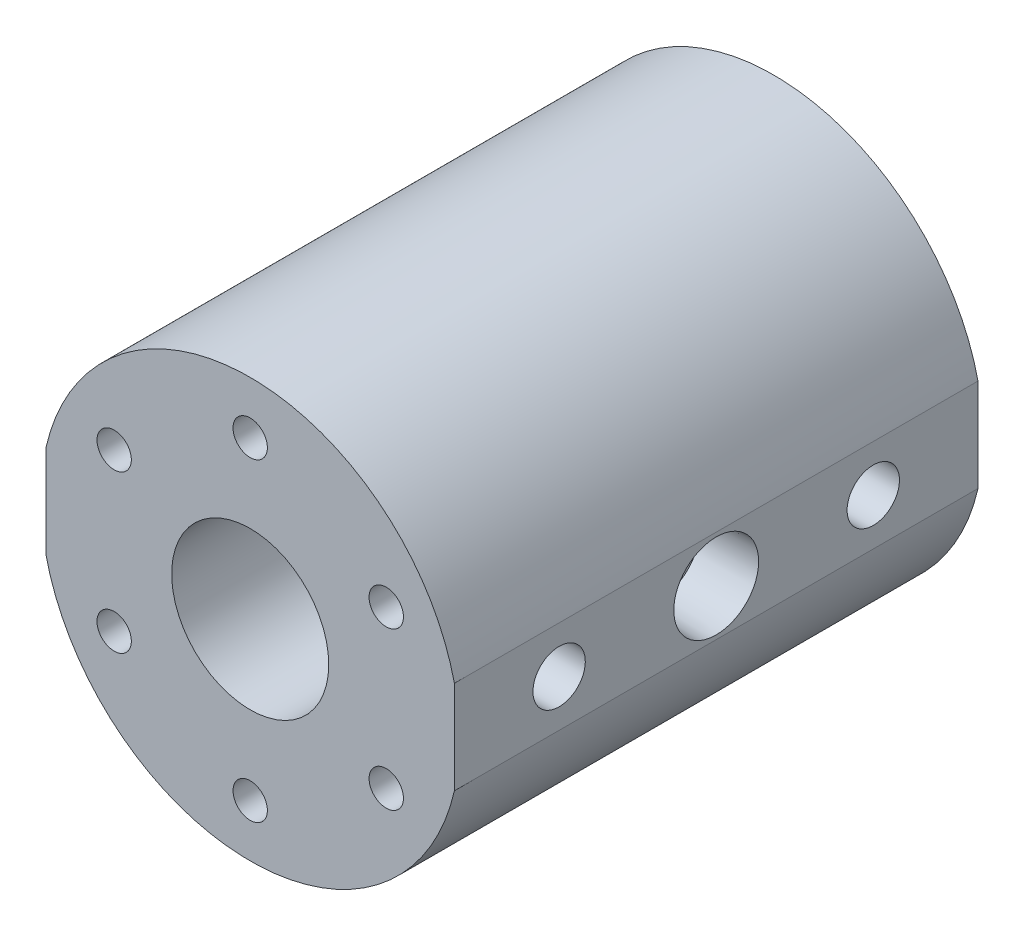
ISO-10303-21;
HEADER;
FILE_DESCRIPTION(('STEP AP214'),'2;1');
FILE_NAME('part.step','',(''),(''),'','','');
FILE_SCHEMA(('AUTOMOTIVE_DESIGN { 1 0 10303 214 1 1 1 1 }'));
ENDSEC;
DATA;
#1=APPLICATION_CONTEXT('core data for automotive mechanical design processes');
#2=APPLICATION_PROTOCOL_DEFINITION('international standard','automotive_design',2000,#1);
#3=PRODUCT_CONTEXT('',#1,'mechanical');
#4=PRODUCT('Part','Part','',(#3));
#5=PRODUCT_RELATED_PRODUCT_CATEGORY('part','',(#4));
#6=PRODUCT_DEFINITION_FORMATION('','',#4);
#7=PRODUCT_DEFINITION_CONTEXT('part definition',#1,'design');
#8=PRODUCT_DEFINITION('design','',#6,#7);
#9=PRODUCT_DEFINITION_SHAPE('','',#8);
#10=(LENGTH_UNIT() NAMED_UNIT(*) SI_UNIT(.MILLI.,.METRE.));
#11=(NAMED_UNIT(*) PLANE_ANGLE_UNIT() SI_UNIT($,.RADIAN.));
#12=(NAMED_UNIT(*) SI_UNIT($,.STERADIAN.) SOLID_ANGLE_UNIT());
#13=UNCERTAINTY_MEASURE_WITH_UNIT(LENGTH_MEASURE(1.E-05),#10,'distance_accuracy_value','');
#14=(GEOMETRIC_REPRESENTATION_CONTEXT(3) GLOBAL_UNCERTAINTY_ASSIGNED_CONTEXT((#13)) GLOBAL_UNIT_ASSIGNED_CONTEXT((#10,
#11,#12)) REPRESENTATION_CONTEXT('',''));
#15=CARTESIAN_POINT('',(0.,0.,0.));
#16=DIRECTION('',(0.,0.,1.));
#17=DIRECTION('',(1.,0.,0.));
#18=AXIS2_PLACEMENT_3D('',#15,#16,#17);
#19=CARTESIAN_POINT('',(0.,0.,31.75));
#20=DIRECTION('',(0.,0.,1.));
#21=DIRECTION('',(1.,0.,0.));
#22=AXIS2_PLACEMENT_3D('',#19,#20,#21);
#23=PLANE('',#22);
#24=CARTESIAN_POINT('',(16.4977839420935,9.52500000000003,31.75));
#25=DIRECTION('',(0.,0.,1.));
#26=DIRECTION('',(1.,0.,0.));
#27=AXIS2_PLACEMENT_3D('',#24,#25,#26);
#28=CIRCLE('',#27,2.08279999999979);
#29=CARTESIAN_POINT('',(18.5805839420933,9.52500000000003,31.75));
#30=VERTEX_POINT('',#29);
#31=EDGE_CURVE('E204',#30,#30,#28,.T.);
#32=ORIENTED_EDGE('',*,*,#31,.F.);
#33=EDGE_LOOP('',(#32));
#34=FACE_BOUND('',#33,.T.);
#35=CARTESIAN_POINT('',(0.,19.05,31.75));
#36=DIRECTION('',(0.,0.,1.));
#37=DIRECTION('',(1.,0.,0.));
#38=AXIS2_PLACEMENT_3D('',#35,#36,#37);
#39=CIRCLE('',#38,2.08279999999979);
#40=CARTESIAN_POINT('',(2.08279999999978,19.05,31.75));
#41=VERTEX_POINT('',#40);
#42=EDGE_CURVE('E216',#41,#41,#39,.T.);
#43=ORIENTED_EDGE('',*,*,#42,.F.);
#44=EDGE_LOOP('',(#43));
#45=FACE_BOUND('',#44,.T.);
#46=CARTESIAN_POINT('',(-16.4977839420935,9.52500000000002,31.75));
#47=DIRECTION('',(0.,0.,1.));
#48=DIRECTION('',(1.,0.,0.));
#49=AXIS2_PLACEMENT_3D('',#46,#47,#48);
#50=CIRCLE('',#49,2.08279999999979);
#51=CARTESIAN_POINT('',(-14.4149839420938,9.52500000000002,31.75));
#52=VERTEX_POINT('',#51);
#53=EDGE_CURVE('E228',#52,#52,#50,.T.);
#54=ORIENTED_EDGE('',*,*,#53,.F.);
#55=EDGE_LOOP('',(#54));
#56=FACE_BOUND('',#55,.T.);
#57=CARTESIAN_POINT('',(-16.4977839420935,-9.52500000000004,31.75));
#58=DIRECTION('',(0.,0.,1.));
#59=DIRECTION('',(1.,0.,0.));
#60=AXIS2_PLACEMENT_3D('',#57,#58,#59);
#61=CIRCLE('',#60,2.08279999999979);
#62=CARTESIAN_POINT('',(-14.4149839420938,-9.52500000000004,31.75));
#63=VERTEX_POINT('',#62);
#64=EDGE_CURVE('E240',#63,#63,#61,.T.);
#65=ORIENTED_EDGE('',*,*,#64,.F.);
#66=EDGE_LOOP('',(#65));
#67=FACE_BOUND('',#66,.T.);
#68=CARTESIAN_POINT('',(16.4977839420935,-9.52500000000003,31.75));
#69=DIRECTION('',(0.,0.,1.));
#70=DIRECTION('',(1.,0.,0.));
#71=AXIS2_PLACEMENT_3D('',#68,#69,#70);
#72=CIRCLE('',#71,2.08279999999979);
#73=CARTESIAN_POINT('',(18.5805839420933,-9.52500000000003,31.75));
#74=VERTEX_POINT('',#73);
#75=EDGE_CURVE('E252',#74,#74,#72,.T.);
#76=ORIENTED_EDGE('',*,*,#75,.F.);
#77=EDGE_LOOP('',(#76));
#78=FACE_BOUND('',#77,.T.);
#79=CARTESIAN_POINT('',(0.,-19.05,31.75));
#80=DIRECTION('',(0.,0.,1.));
#81=DIRECTION('',(1.,0.,0.));
#82=AXIS2_PLACEMENT_3D('',#79,#80,#81);
#83=CIRCLE('',#82,2.08279999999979);
#84=CARTESIAN_POINT('',(2.08279999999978,-19.05,31.75));
#85=VERTEX_POINT('',#84);
#86=EDGE_CURVE('E264',#85,#85,#83,.T.);
#87=ORIENTED_EDGE('',*,*,#86,.F.);
#88=EDGE_LOOP('',(#87));
#89=FACE_BOUND('',#88,.T.);
#90=CARTESIAN_POINT('',(0.,0.,31.75));
#91=DIRECTION('',(0.,0.,1.));
#92=DIRECTION('',(1.,0.,0.));
#93=AXIS2_PLACEMENT_3D('',#90,#91,#92);
#94=CIRCLE('',#93,25.4);
#95=CARTESIAN_POINT('',(24.765,5.64400345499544,31.75));
#96=VERTEX_POINT('',#95);
#97=CARTESIAN_POINT('',(-24.765,5.64400345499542,31.75));
#98=VERTEX_POINT('',#97);
#99=EDGE_CURVE('E282',#96,#98,#94,.T.);
#100=ORIENTED_EDGE('',*,*,#99,.T.);
#101=DIRECTION('',(0.,-1.,0.));
#102=VECTOR('',#101,1.);
#103=CARTESIAN_POINT('',(-24.765,5.64400345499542,31.75));
#104=LINE('',#103,#102);
#105=CARTESIAN_POINT('',(-24.765,-5.64400345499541,31.75));
#106=VERTEX_POINT('',#105);
#107=EDGE_CURVE('E284',#98,#106,#104,.T.);
#108=ORIENTED_EDGE('',*,*,#107,.T.);
#109=CARTESIAN_POINT('',(0.,0.,31.75));
#110=DIRECTION('',(0.,0.,1.));
#111=DIRECTION('',(1.,0.,0.));
#112=AXIS2_PLACEMENT_3D('',#109,#110,#111);
#113=CIRCLE('',#112,25.4);
#114=CARTESIAN_POINT('',(24.765,-5.64400345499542,31.75));
#115=VERTEX_POINT('',#114);
#116=EDGE_CURVE('E54',#106,#115,#113,.T.);
#117=ORIENTED_EDGE('',*,*,#116,.T.);
#118=DIRECTION('',(0.,1.,0.));
#119=VECTOR('',#118,1.);
#120=CARTESIAN_POINT('',(24.765,5.64400345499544,31.75));
#121=LINE('',#120,#119);
#122=EDGE_CURVE('E49',#115,#96,#121,.T.);
#123=ORIENTED_EDGE('',*,*,#122,.T.);
#124=EDGE_LOOP('',(#100,#108,#117,#123));
#125=FACE_BOUND('',#124,.T.);
#126=CARTESIAN_POINT('',(0.,0.,31.75));
#127=DIRECTION('',(0.,0.,1.));
#128=DIRECTION('',(1.,0.,0.));
#129=AXIS2_PLACEMENT_3D('',#126,#127,#128);
#130=CIRCLE('',#129,9.525);
#131=CARTESIAN_POINT('',(9.525,0.,31.75));
#132=VERTEX_POINT('',#131);
#133=EDGE_CURVE('E270',#132,#132,#130,.T.);
#134=ORIENTED_EDGE('',*,*,#133,.F.);
#135=EDGE_LOOP('',(#134));
#136=FACE_BOUND('',#135,.T.);
#137=ADVANCED_FACE('F34',(#34,#45,#56,#67,#78,#89,#125,#136),#23,.T.);
#138=CARTESIAN_POINT('',(0.,0.,-31.75));
#139=DIRECTION('',(0.,0.,1.));
#140=DIRECTION('',(1.,0.,0.));
#141=AXIS2_PLACEMENT_3D('',#138,#139,#140);
#142=PLANE('',#141);
#143=CARTESIAN_POINT('',(16.4977839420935,9.52500000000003,-31.75));
#144=DIRECTION('',(0.,0.,-1.));
#145=DIRECTION('',(-1.,0.,0.));
#146=AXIS2_PLACEMENT_3D('',#143,#144,#145);
#147=CIRCLE('',#146,2.08279999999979);
#148=CARTESIAN_POINT('',(14.4149839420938,9.52500000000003,-31.75));
#149=VERTEX_POINT('',#148);
#150=EDGE_CURVE('E132',#149,#149,#147,.T.);
#151=ORIENTED_EDGE('',*,*,#150,.F.);
#152=EDGE_LOOP('',(#151));
#153=FACE_BOUND('',#152,.T.);
#154=CARTESIAN_POINT('',(0.,19.05,-31.75));
#155=DIRECTION('',(0.,0.,-1.));
#156=DIRECTION('',(-1.,0.,0.));
#157=AXIS2_PLACEMENT_3D('',#154,#155,#156);
#158=CIRCLE('',#157,2.08279999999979);
#159=CARTESIAN_POINT('',(-2.08279999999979,19.05,-31.75));
#160=VERTEX_POINT('',#159);
#161=EDGE_CURVE('E144',#160,#160,#158,.T.);
#162=ORIENTED_EDGE('',*,*,#161,.F.);
#163=EDGE_LOOP('',(#162));
#164=FACE_BOUND('',#163,.T.);
#165=CARTESIAN_POINT('',(-16.4977839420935,9.52500000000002,-31.75));
#166=DIRECTION('',(0.,0.,-1.));
#167=DIRECTION('',(-1.,0.,0.));
#168=AXIS2_PLACEMENT_3D('',#165,#166,#167);
#169=CIRCLE('',#168,2.08279999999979);
#170=CARTESIAN_POINT('',(-18.5805839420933,9.52500000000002,-31.75));
#171=VERTEX_POINT('',#170);
#172=EDGE_CURVE('E156',#171,#171,#169,.T.);
#173=ORIENTED_EDGE('',*,*,#172,.F.);
#174=EDGE_LOOP('',(#173));
#175=FACE_BOUND('',#174,.T.);
#176=CARTESIAN_POINT('',(-16.4977839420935,-9.52500000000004,-31.75));
#177=DIRECTION('',(0.,0.,-1.));
#178=DIRECTION('',(-1.,0.,0.));
#179=AXIS2_PLACEMENT_3D('',#176,#177,#178);
#180=CIRCLE('',#179,2.08279999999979);
#181=CARTESIAN_POINT('',(-18.5805839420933,-9.52500000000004,-31.75));
#182=VERTEX_POINT('',#181);
#183=EDGE_CURVE('E168',#182,#182,#180,.T.);
#184=ORIENTED_EDGE('',*,*,#183,.F.);
#185=EDGE_LOOP('',(#184));
#186=FACE_BOUND('',#185,.T.);
#187=CARTESIAN_POINT('',(16.4977839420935,-9.52500000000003,-31.75));
#188=DIRECTION('',(0.,0.,-1.));
#189=DIRECTION('',(-1.,0.,0.));
#190=AXIS2_PLACEMENT_3D('',#187,#188,#189);
#191=CIRCLE('',#190,2.08279999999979);
#192=CARTESIAN_POINT('',(14.4149839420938,-9.52500000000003,-31.75));
#193=VERTEX_POINT('',#192);
#194=EDGE_CURVE('E180',#193,#193,#191,.T.);
#195=ORIENTED_EDGE('',*,*,#194,.F.);
#196=EDGE_LOOP('',(#195));
#197=FACE_BOUND('',#196,.T.);
#198=CARTESIAN_POINT('',(0.,-19.05,-31.75));
#199=DIRECTION('',(0.,0.,-1.));
#200=DIRECTION('',(-1.,0.,0.));
#201=AXIS2_PLACEMENT_3D('',#198,#199,#200);
#202=CIRCLE('',#201,2.08279999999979);
#203=CARTESIAN_POINT('',(-2.08279999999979,-19.05,-31.75));
#204=VERTEX_POINT('',#203);
#205=EDGE_CURVE('E192',#204,#204,#202,.T.);
#206=ORIENTED_EDGE('',*,*,#205,.F.);
#207=EDGE_LOOP('',(#206));
#208=FACE_BOUND('',#207,.T.);
#209=CARTESIAN_POINT('',(0.,0.,-31.75));
#210=DIRECTION('',(0.,0.,1.));
#211=DIRECTION('',(1.,0.,0.));
#212=AXIS2_PLACEMENT_3D('',#209,#210,#211);
#213=CIRCLE('',#212,25.4);
#214=CARTESIAN_POINT('',(24.765,5.64400345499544,-31.75));
#215=VERTEX_POINT('',#214);
#216=CARTESIAN_POINT('',(-24.765,5.64400345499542,-31.75));
#217=VERTEX_POINT('',#216);
#218=EDGE_CURVE('E273',#215,#217,#213,.T.);
#219=ORIENTED_EDGE('',*,*,#218,.F.);
#220=DIRECTION('',(0.,1.,0.));
#221=VECTOR('',#220,1.);
#222=CARTESIAN_POINT('',(24.765,5.64400345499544,-31.75));
#223=LINE('',#222,#221);
#224=CARTESIAN_POINT('',(24.765,-5.64400345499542,-31.75));
#225=VERTEX_POINT('',#224);
#226=EDGE_CURVE('E280',#225,#215,#223,.T.);
#227=ORIENTED_EDGE('',*,*,#226,.F.);
#228=CARTESIAN_POINT('',(0.,0.,-31.75));
#229=DIRECTION('',(0.,0.,1.));
#230=DIRECTION('',(1.,0.,0.));
#231=AXIS2_PLACEMENT_3D('',#228,#229,#230);
#232=CIRCLE('',#231,25.4);
#233=CARTESIAN_POINT('',(-24.765,-5.64400345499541,-31.75));
#234=VERTEX_POINT('',#233);
#235=EDGE_CURVE('E278',#234,#225,#232,.T.);
#236=ORIENTED_EDGE('',*,*,#235,.F.);
#237=DIRECTION('',(0.,-1.,0.));
#238=VECTOR('',#237,1.);
#239=CARTESIAN_POINT('',(-24.765,5.64400345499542,-31.75));
#240=LINE('',#239,#238);
#241=EDGE_CURVE('E276',#217,#234,#240,.T.);
#242=ORIENTED_EDGE('',*,*,#241,.F.);
#243=EDGE_LOOP('',(#219,#227,#236,#242));
#244=FACE_BOUND('',#243,.T.);
#245=CARTESIAN_POINT('',(0.,0.,-31.75));
#246=DIRECTION('',(0.,0.,1.));
#247=DIRECTION('',(1.,0.,0.));
#248=AXIS2_PLACEMENT_3D('',#245,#246,#247);
#249=CIRCLE('',#248,9.525);
#250=CARTESIAN_POINT('',(9.525,0.,-31.75));
#251=VERTEX_POINT('',#250);
#252=EDGE_CURVE('E267',#251,#251,#249,.T.);
#253=ORIENTED_EDGE('',*,*,#252,.T.);
#254=EDGE_LOOP('',(#253));
#255=FACE_BOUND('',#254,.T.);
#256=ADVANCED_FACE('F302',(#153,#164,#175,#186,#197,#208,#244,#255),#142,.F.);
#257=CARTESIAN_POINT('',(0.,0.,31.75));
#258=DIRECTION('',(0.,0.,-1.));
#259=DIRECTION('',(-1.,0.,0.));
#260=AXIS2_PLACEMENT_3D('',#257,#258,#259);
#261=CYLINDRICAL_SURFACE('',#260,25.4);
#262=ORIENTED_EDGE('',*,*,#218,.T.);
#263=DIRECTION('',(0.,0.,-1.));
#264=VECTOR('',#263,1.);
#265=CARTESIAN_POINT('',(-24.765,5.64400345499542,31.75));
#266=LINE('',#265,#264);
#267=EDGE_CURVE('E11',#98,#217,#266,.T.);
#268=ORIENTED_EDGE('',*,*,#267,.F.);
#269=ORIENTED_EDGE('',*,*,#99,.F.);
#270=DIRECTION('',(0.,0.,-1.));
#271=VECTOR('',#270,1.);
#272=CARTESIAN_POINT('',(24.765,5.64400345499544,31.75));
#273=LINE('',#272,#271);
#274=EDGE_CURVE('E288',#96,#215,#273,.T.);
#275=ORIENTED_EDGE('',*,*,#274,.T.);
#276=EDGE_LOOP('',(#262,#268,#269,#275));
#277=FACE_BOUND('',#276,.T.);
#278=ADVANCED_FACE('F36',(#277),#261,.T.);
#279=CARTESIAN_POINT('',(-24.765,5.64400345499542,31.75));
#280=DIRECTION('',(1.,0.,0.));
#281=DIRECTION('',(0.,1.,0.));
#282=AXIS2_PLACEMENT_3D('',#279,#280,#281);
#283=PLANE('',#282);
#284=CARTESIAN_POINT('',(-24.765,0.,12.7));
#285=DIRECTION('',(-1.,0.,0.));
#286=DIRECTION('',(0.,0.,1.));
#287=AXIS2_PLACEMENT_3D('',#284,#285,#286);
#288=CIRCLE('',#287,5.1435);
#289=CARTESIAN_POINT('',(-24.765,0.,17.8435));
#290=VERTEX_POINT('',#289);
#291=EDGE_CURVE('E366',#290,#290,#288,.T.);
#292=ORIENTED_EDGE('',*,*,#291,.F.);
#293=EDGE_LOOP('',(#292));
#294=FACE_BOUND('',#293,.T.);
#295=CARTESIAN_POINT('',(-24.765,0.,-12.7));
#296=DIRECTION('',(-1.,0.,0.));
#297=DIRECTION('',(0.,0.,1.));
#298=AXIS2_PLACEMENT_3D('',#295,#296,#297);
#299=CIRCLE('',#298,5.1435);
#300=CARTESIAN_POINT('',(-24.765,0.,-7.5565));
#301=VERTEX_POINT('',#300);
#302=EDGE_CURVE('E378',#301,#301,#299,.T.);
#303=ORIENTED_EDGE('',*,*,#302,.F.);
#304=EDGE_LOOP('',(#303));
#305=FACE_BOUND('',#304,.T.);
#306=ORIENTED_EDGE('',*,*,#241,.T.);
#307=DIRECTION('',(0.,0.,-1.));
#308=VECTOR('',#307,1.);
#309=CARTESIAN_POINT('',(-24.765,-5.64400345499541,31.75));
#310=LINE('',#309,#308);
#311=EDGE_CURVE('E42',#106,#234,#310,.T.);
#312=ORIENTED_EDGE('',*,*,#311,.F.);
#313=ORIENTED_EDGE('',*,*,#107,.F.);
#314=ORIENTED_EDGE('',*,*,#267,.T.);
#315=EDGE_LOOP('',(#306,#312,#313,#314));
#316=FACE_BOUND('',#315,.T.);
#317=ADVANCED_FACE('F310',(#294,#305,#316),#283,.F.);
#318=CARTESIAN_POINT('',(0.,0.,31.75));
#319=DIRECTION('',(0.,0.,-1.));
#320=DIRECTION('',(-1.,0.,0.));
#321=AXIS2_PLACEMENT_3D('',#318,#319,#320);
#322=CYLINDRICAL_SURFACE('',#321,25.4);
#323=ORIENTED_EDGE('',*,*,#235,.T.);
#324=DIRECTION('',(0.,0.,-1.));
#325=VECTOR('',#324,1.);
#326=CARTESIAN_POINT('',(24.765,-5.64400345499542,31.75));
#327=LINE('',#326,#325);
#328=EDGE_CURVE('E291',#115,#225,#327,.T.);
#329=ORIENTED_EDGE('',*,*,#328,.F.);
#330=ORIENTED_EDGE('',*,*,#116,.F.);
#331=ORIENTED_EDGE('',*,*,#311,.T.);
#332=EDGE_LOOP('',(#323,#329,#330,#331));
#333=FACE_BOUND('',#332,.T.);
#334=ADVANCED_FACE('F297',(#333),#322,.T.);
#335=CARTESIAN_POINT('',(24.765,5.64400345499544,31.75));
#336=DIRECTION('',(-1.,0.,0.));
#337=DIRECTION('',(0.,-1.,0.));
#338=AXIS2_PLACEMENT_3D('',#335,#336,#337);
#339=PLANE('',#338);
#340=CARTESIAN_POINT('',(24.765,0.,-19.05));
#341=DIRECTION('',(1.,0.,0.));
#342=DIRECTION('',(0.,1.,0.));
#343=AXIS2_PLACEMENT_3D('',#340,#341,#342);
#344=CIRCLE('',#343,3.175);
#345=CARTESIAN_POINT('',(24.765,3.17500000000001,-19.05));
#346=VERTEX_POINT('',#345);
#347=EDGE_CURVE('E343',#346,#346,#344,.T.);
#348=ORIENTED_EDGE('',*,*,#347,.F.);
#349=EDGE_LOOP('',(#348));
#350=FACE_BOUND('',#349,.T.);
#351=CARTESIAN_POINT('',(24.765,0.,19.05));
#352=DIRECTION('',(1.,0.,0.));
#353=DIRECTION('',(0.,1.,0.));
#354=AXIS2_PLACEMENT_3D('',#351,#352,#353);
#355=CIRCLE('',#354,3.175);
#356=CARTESIAN_POINT('',(24.765,3.17500000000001,19.05));
#357=VERTEX_POINT('',#356);
#358=EDGE_CURVE('E347',#357,#357,#355,.T.);
#359=ORIENTED_EDGE('',*,*,#358,.F.);
#360=EDGE_LOOP('',(#359));
#361=FACE_BOUND('',#360,.T.);
#362=CARTESIAN_POINT('',(24.765,0.,0.));
#363=DIRECTION('',(1.,0.,0.));
#364=DIRECTION('',(0.,0.,-1.));
#365=AXIS2_PLACEMENT_3D('',#362,#363,#364);
#366=CIRCLE('',#365,5.1435);
#367=CARTESIAN_POINT('',(24.765,0.,-5.1435));
#368=VERTEX_POINT('',#367);
#369=EDGE_CURVE('E350',#368,#368,#366,.T.);
#370=ORIENTED_EDGE('',*,*,#369,.F.);
#371=EDGE_LOOP('',(#370));
#372=FACE_BOUND('',#371,.T.);
#373=ORIENTED_EDGE('',*,*,#226,.T.);
#374=ORIENTED_EDGE('',*,*,#274,.F.);
#375=ORIENTED_EDGE('',*,*,#122,.F.);
#376=ORIENTED_EDGE('',*,*,#328,.T.);
#377=EDGE_LOOP('',(#373,#374,#375,#376));
#378=FACE_BOUND('',#377,.T.);
#379=ADVANCED_FACE('F305',(#350,#361,#372,#378),#339,.F.);
#380=CARTESIAN_POINT('',(0.,0.,31.75));
#381=DIRECTION('',(0.,0.,-1.));
#382=DIRECTION('',(-1.,0.,0.));
#383=AXIS2_PLACEMENT_3D('',#380,#381,#382);
#384=CYLINDRICAL_SURFACE('',#383,9.525);
#385=CARTESIAN_POINT('',(-8.98025612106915,-3.17500000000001,-12.7));
#386=CARTESIAN_POINT('',(-8.98025555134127,-3.175000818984,-12.5270635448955));
#387=CARTESIAN_POINT('',(-8.98530617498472,-3.16082293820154,-12.3541320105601));
#388=CARTESIAN_POINT('',(-9.00485797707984,-3.10467734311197,-12.0133922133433));
#389=CARTESIAN_POINT('',(-9.01936071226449,-3.06270505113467,-11.8455847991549));
#390=CARTESIAN_POINT('',(-9.05599546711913,-2.95260866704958,-11.5200846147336));
#391=CARTESIAN_POINT('',(-9.07811252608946,-2.88453582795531,-11.3623727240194));
#392=CARTESIAN_POINT('',(-9.12746212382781,-2.72434567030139,-11.0605568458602));
#393=CARTESIAN_POINT('',(-9.15469579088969,-2.63222304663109,-10.9164558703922));
#394=CARTESIAN_POINT('',(-9.21240503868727,-2.42268738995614,-10.6403141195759));
#395=CARTESIAN_POINT('',(-9.24296141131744,-2.3044922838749,-10.5088835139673));
#396=CARTESIAN_POINT('',(-9.30319020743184,-2.04783584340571,-10.2672934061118));
#397=CARTESIAN_POINT('',(-9.33286248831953,-1.9093712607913,-10.157137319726));
#398=CARTESIAN_POINT('',(-9.38891527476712,-1.61164431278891,-9.95845450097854));
#399=CARTESIAN_POINT('',(-9.41518969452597,-1.45193356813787,-9.87056709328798));
#400=CARTESIAN_POINT('',(-9.46053437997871,-1.11896913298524,-9.72314671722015));
#401=CARTESIAN_POINT('',(-9.47960658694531,-0.945719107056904,-9.66360610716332));
#402=CARTESIAN_POINT('',(-9.50782564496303,-0.596991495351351,-9.57663866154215));
#403=CARTESIAN_POINT('',(-9.5172947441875,-0.421801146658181,-9.548166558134));
#404=CARTESIAN_POINT('',(-9.52638456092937,-0.06889075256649,-9.52082076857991));
#405=CARTESIAN_POINT('',(-9.52600781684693,0.108828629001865,-9.52193945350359));
#406=CARTESIAN_POINT('',(-9.51566675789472,0.454353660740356,-9.55308050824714));
#407=CARTESIAN_POINT('',(-9.50607905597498,0.622274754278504,-9.5819675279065));
#408=CARTESIAN_POINT('',(-9.47886621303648,0.95073291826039,-9.665947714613));
#409=CARTESIAN_POINT('',(-9.46124052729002,1.11126948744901,-9.72104265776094));
#410=CARTESIAN_POINT('',(-9.41945253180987,1.42288410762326,-9.85653768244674));
#411=CARTESIAN_POINT('',(-9.3952073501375,1.57381010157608,-9.93726085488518));
#412=CARTESIAN_POINT('',(-9.34270397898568,1.86030973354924,-10.1214545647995));
#413=CARTESIAN_POINT('',(-9.31444467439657,1.99587908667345,-10.2249314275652));
#414=CARTESIAN_POINT('',(-9.25532159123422,2.2545702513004,-10.4574161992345));
#415=CARTESIAN_POINT('',(-9.22439783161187,2.37680549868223,-10.5873967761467));
#416=CARTESIAN_POINT('',(-9.1645528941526,2.5980302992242,-10.866274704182));
#417=CARTESIAN_POINT('',(-9.13563202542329,2.69701626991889,-11.0151749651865));
#418=CARTESIAN_POINT('',(-9.08273917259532,2.87016016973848,-11.3304752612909));
#419=CARTESIAN_POINT('',(-9.05884361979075,2.94394402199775,-11.4970945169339));
#420=CARTESIAN_POINT('',(-9.01959241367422,3.06210713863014,-11.8413891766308));
#421=CARTESIAN_POINT('',(-9.0042331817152,3.10649872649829,-12.0190599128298));
#422=CARTESIAN_POINT('',(-8.98460345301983,3.16281207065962,-12.3718267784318));
#423=CARTESIAN_POINT('',(-8.9798639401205,3.17610837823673,-12.546677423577));
#424=CARTESIAN_POINT('',(-8.9806993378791,3.17374726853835,-12.8961392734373));
#425=CARTESIAN_POINT('',(-8.98627237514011,3.15809511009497,-13.0707505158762));
#426=CARTESIAN_POINT('',(-9.00663737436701,3.09951644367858,-13.4085233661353));
#427=CARTESIAN_POINT('',(-9.02110608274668,3.05754530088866,-13.5718722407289));
#428=CARTESIAN_POINT('',(-9.05727657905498,2.94866651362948,-13.8891759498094));
#429=CARTESIAN_POINT('',(-9.07897964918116,2.88175444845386,-14.0431291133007));
#430=CARTESIAN_POINT('',(-9.12802586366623,2.72248103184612,-14.3426828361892));
#431=CARTESIAN_POINT('',(-9.1555260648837,2.62937980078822,-14.4878635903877));
#432=CARTESIAN_POINT('',(-9.21276315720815,2.42120937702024,-14.7610387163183));
#433=CARTESIAN_POINT('',(-9.24250070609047,2.30613370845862,-14.8890280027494));
#434=CARTESIAN_POINT('',(-9.30259247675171,2.05070616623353,-15.1305513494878));
#435=CARTESIAN_POINT('',(-9.33290753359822,1.90940458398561,-15.2430936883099));
#436=CARTESIAN_POINT('',(-9.3893275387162,1.60917665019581,-15.442933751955));
#437=CARTESIAN_POINT('',(-9.41543263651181,1.45025092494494,-15.5302323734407));
#438=CARTESIAN_POINT('',(-9.46036988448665,1.12007606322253,-15.6763088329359));
#439=CARTESIAN_POINT('',(-9.47924920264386,0.94891581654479,-15.7352723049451));
#440=CARTESIAN_POINT('',(-9.50781089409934,0.598355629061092,-15.8233355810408));
#441=CARTESIAN_POINT('',(-9.51749658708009,0.418958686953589,-15.8524461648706));
#442=CARTESIAN_POINT('',(-9.52632915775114,0.0660886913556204,-15.8790070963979));
#443=CARTESIAN_POINT('',(-9.52594996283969,-0.107266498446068,-15.8778811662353));
#444=CARTESIAN_POINT('',(-9.51586223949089,-0.451202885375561,-15.8475130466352));
#445=CARTESIAN_POINT('',(-9.50615446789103,-0.621784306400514,-15.818273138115));
#446=CARTESIAN_POINT('',(-9.47867404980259,-0.952633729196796,-15.7334514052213));
#447=CARTESIAN_POINT('',(-9.46103195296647,-1.11302251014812,-15.6782953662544));
#448=CARTESIAN_POINT('',(-9.41949985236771,-1.42233126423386,-15.5436013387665));
#449=CARTESIAN_POINT('',(-9.39560871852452,-1.57124915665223,-15.4640589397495));
#450=CARTESIAN_POINT('',(-9.34294133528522,-1.8593880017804,-15.2794667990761));
#451=CARTESIAN_POINT('',(-9.31401720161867,-1.99804734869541,-15.1735831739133));
#452=CARTESIAN_POINT('',(-9.25490239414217,-2.25609475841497,-14.9407327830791));
#453=CARTESIAN_POINT('',(-9.22471131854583,-2.37547664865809,-14.8137592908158));
#454=CARTESIAN_POINT('',(-9.16505913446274,-2.59633024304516,-14.5363902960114));
#455=CARTESIAN_POINT('',(-9.13567286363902,-2.69691791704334,-14.3852725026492));
#456=CARTESIAN_POINT('',(-9.08241113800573,-2.87119803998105,-14.0673631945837));
#457=CARTESIAN_POINT('',(-9.05853424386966,-2.94489751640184,-13.9005757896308));
#458=CARTESIAN_POINT('',(-9.02021736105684,-3.06020415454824,-13.5637212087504));
#459=CARTESIAN_POINT('',(-9.00539959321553,-3.10311136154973,-13.394143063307));
#460=CARTESIAN_POINT('',(-8.9854209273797,-3.16050396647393,-13.0497070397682));
#461=CARTESIAN_POINT('',(-8.98025669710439,-3.17499917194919,-12.874851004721));
#462=CARTESIAN_POINT('',(-8.98025612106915,-3.17500000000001,-12.7));
#463=B_SPLINE_CURVE_WITH_KNOTS('',3,(#385,#386,#387,#388,#389,#390,#391,#392,#393,#394,#395,
#396,#397,#398,#399,#400,#401,#402,#403,#404,#405,#406,#407,#408,#409,#410,#411,#412,#413,#414,
#415,#416,#417,#418,#419,#420,#421,#422,#423,#424,#425,#426,#427,#428,#429,#430,#431,#432,#433,
#434,#435,#436,#437,#438,#439,#440,#441,#442,#443,#444,#445,#446,#447,#448,#449,#450,#451,#452,
#453,#454,#455,#456,#457,#458,#459,#460,#461,#462),.UNSPECIFIED.,.T.,.F.,(4,2,2,2,2,2,2,2,2,2,2,
2,2,2,2,2,2,2,2,2,2,2,2,2,2,2,2,2,2,2,2,2,2,2,2,2,2,2,4),(0.,0.518161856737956,1.03640907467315,
1.55364379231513,2.07099270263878,2.60671746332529,3.14252816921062,3.69231882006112,
4.24196117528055,4.77247962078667,5.30286129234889,5.81244090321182,6.32205505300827,
6.83836754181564,7.3548237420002,7.89559553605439,8.43645060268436,8.98501631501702,
9.53335188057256,10.056948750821,10.5804505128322,11.0859695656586,11.5915782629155,
12.113223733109,12.6350231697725,13.1819271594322,13.7288117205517,14.2720628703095,
14.815117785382,15.3326491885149,15.8501386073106,16.3594083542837,16.868770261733,
17.3969527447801,17.9253040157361,18.4743376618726,19.023227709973,19.5473069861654,
20.0712053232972),.UNSPECIFIED.);
#464=CARTESIAN_POINT('',(-8.98025612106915,-3.17500000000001,-12.7));
#465=VERTEX_POINT('',#464);
#466=EDGE_CURVE('E1053',#465,#465,#463,.T.);
#467=ORIENTED_EDGE('',*,*,#466,.T.);
#468=EDGE_LOOP('',(#467));
#469=FACE_BOUND('',#468,.T.);
#470=CARTESIAN_POINT('',(-8.98025612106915,-3.17500000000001,12.7));
#471=CARTESIAN_POINT('',(-8.98025555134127,-3.175000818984,12.8729364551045));
#472=CARTESIAN_POINT('',(-8.98530617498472,-3.16082293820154,13.0458679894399));
#473=CARTESIAN_POINT('',(-9.00485797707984,-3.10467734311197,13.3866077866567));
#474=CARTESIAN_POINT('',(-9.01936071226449,-3.06270505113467,13.5544152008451));
#475=CARTESIAN_POINT('',(-9.05599546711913,-2.95260866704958,13.8799153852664));
#476=CARTESIAN_POINT('',(-9.07811252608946,-2.88453582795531,14.0376272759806));
#477=CARTESIAN_POINT('',(-9.12746212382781,-2.72434567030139,14.3394431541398));
#478=CARTESIAN_POINT('',(-9.15469579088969,-2.63222304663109,14.4835441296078));
#479=CARTESIAN_POINT('',(-9.21240503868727,-2.42268738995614,14.7596858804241));
#480=CARTESIAN_POINT('',(-9.24296141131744,-2.3044922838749,14.8911164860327));
#481=CARTESIAN_POINT('',(-9.30319020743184,-2.04783584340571,15.1327065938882));
#482=CARTESIAN_POINT('',(-9.33286248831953,-1.9093712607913,15.242862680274));
#483=CARTESIAN_POINT('',(-9.38891527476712,-1.61164431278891,15.4415454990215));
#484=CARTESIAN_POINT('',(-9.41518969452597,-1.45193356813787,15.529432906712));
#485=CARTESIAN_POINT('',(-9.46053437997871,-1.11896913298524,15.6768532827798));
#486=CARTESIAN_POINT('',(-9.47960658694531,-0.945719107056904,15.7363938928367));
#487=CARTESIAN_POINT('',(-9.50782564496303,-0.596991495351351,15.8233613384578));
#488=CARTESIAN_POINT('',(-9.5172947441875,-0.421801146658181,15.851833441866));
#489=CARTESIAN_POINT('',(-9.52638456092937,-0.0688907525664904,15.8791792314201));
#490=CARTESIAN_POINT('',(-9.52600781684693,0.108828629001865,15.8780605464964));
#491=CARTESIAN_POINT('',(-9.51566675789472,0.454353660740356,15.8469194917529));
#492=CARTESIAN_POINT('',(-9.50607905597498,0.622274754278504,15.8180324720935));
#493=CARTESIAN_POINT('',(-9.47886621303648,0.950732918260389,15.734052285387));
#494=CARTESIAN_POINT('',(-9.46124052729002,1.111269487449,15.6789573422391));
#495=CARTESIAN_POINT('',(-9.41945253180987,1.42288410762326,15.5434623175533));
#496=CARTESIAN_POINT('',(-9.3952073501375,1.57381010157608,15.4627391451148));
#497=CARTESIAN_POINT('',(-9.34270397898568,1.86030973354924,15.2785454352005));
#498=CARTESIAN_POINT('',(-9.31444467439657,1.99587908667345,15.1750685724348));
#499=CARTESIAN_POINT('',(-9.25532159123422,2.2545702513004,14.9425838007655));
#500=CARTESIAN_POINT('',(-9.22439783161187,2.37680549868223,14.8126032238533));
#501=CARTESIAN_POINT('',(-9.1645528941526,2.5980302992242,14.533725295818));
#502=CARTESIAN_POINT('',(-9.13563202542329,2.69701626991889,14.3848250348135));
#503=CARTESIAN_POINT('',(-9.08273917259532,2.87016016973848,14.0695247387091));
#504=CARTESIAN_POINT('',(-9.05884361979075,2.94394402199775,13.9029054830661));
#505=CARTESIAN_POINT('',(-9.01959241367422,3.06210713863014,13.5586108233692));
#506=CARTESIAN_POINT('',(-9.0042331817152,3.10649872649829,13.3809400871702));
#507=CARTESIAN_POINT('',(-8.98460345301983,3.16281207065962,13.0281732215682));
#508=CARTESIAN_POINT('',(-8.9798639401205,3.17610837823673,12.853322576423));
#509=CARTESIAN_POINT('',(-8.9806993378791,3.17374726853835,12.5038607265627));
#510=CARTESIAN_POINT('',(-8.98627237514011,3.15809511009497,12.3292494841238));
#511=CARTESIAN_POINT('',(-9.00663737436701,3.09951644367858,11.9914766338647));
#512=CARTESIAN_POINT('',(-9.02110608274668,3.05754530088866,11.8281277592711));
#513=CARTESIAN_POINT('',(-9.05727657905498,2.94866651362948,11.5108240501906));
#514=CARTESIAN_POINT('',(-9.07897964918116,2.88175444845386,11.3568708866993));
#515=CARTESIAN_POINT('',(-9.12802586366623,2.72248103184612,11.0573171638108));
#516=CARTESIAN_POINT('',(-9.1555260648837,2.62937980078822,10.9121364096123));
#517=CARTESIAN_POINT('',(-9.21276315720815,2.42120937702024,10.6389612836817));
#518=CARTESIAN_POINT('',(-9.24250070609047,2.30613370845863,10.5109719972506));
#519=CARTESIAN_POINT('',(-9.30259247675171,2.05070616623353,10.2694486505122));
#520=CARTESIAN_POINT('',(-9.33290753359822,1.90940458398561,10.1569063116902));
#521=CARTESIAN_POINT('',(-9.3893275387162,1.60917665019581,9.95706624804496));
#522=CARTESIAN_POINT('',(-9.41543263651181,1.45025092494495,9.8697676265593));
#523=CARTESIAN_POINT('',(-9.46036988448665,1.12007606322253,9.72369116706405));
#524=CARTESIAN_POINT('',(-9.47924920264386,0.948915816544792,9.66472769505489));
#525=CARTESIAN_POINT('',(-9.50781089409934,0.598355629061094,9.57666441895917));
#526=CARTESIAN_POINT('',(-9.51749658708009,0.418958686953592,9.5475538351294));
#527=CARTESIAN_POINT('',(-9.52632915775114,0.0660886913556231,9.52099290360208));
#528=CARTESIAN_POINT('',(-9.52594996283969,-0.107266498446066,9.5221188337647));
#529=CARTESIAN_POINT('',(-9.51586223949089,-0.451202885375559,9.55248695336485));
#530=CARTESIAN_POINT('',(-9.50615446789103,-0.621784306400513,9.58172686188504));
#531=CARTESIAN_POINT('',(-9.47867404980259,-0.952633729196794,9.66654859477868));
#532=CARTESIAN_POINT('',(-9.46103195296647,-1.11302251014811,9.72170463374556));
#533=CARTESIAN_POINT('',(-9.41949985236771,-1.42233126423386,9.85639866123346));
#534=CARTESIAN_POINT('',(-9.39560871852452,-1.57124915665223,9.93594106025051));
#535=CARTESIAN_POINT('',(-9.34294133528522,-1.8593880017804,10.1205332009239));
#536=CARTESIAN_POINT('',(-9.31401720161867,-1.99804734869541,10.2264168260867));
#537=CARTESIAN_POINT('',(-9.25490239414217,-2.25609475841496,10.4592672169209));
#538=CARTESIAN_POINT('',(-9.22471131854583,-2.37547664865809,10.5862407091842));
#539=CARTESIAN_POINT('',(-9.16505913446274,-2.59633024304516,10.8636097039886));
#540=CARTESIAN_POINT('',(-9.13567286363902,-2.69691791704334,11.0147274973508));
#541=CARTESIAN_POINT('',(-9.08241113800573,-2.87119803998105,11.3326368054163));
#542=CARTESIAN_POINT('',(-9.05853424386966,-2.94489751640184,11.4994242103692));
#543=CARTESIAN_POINT('',(-9.02021736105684,-3.06020415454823,11.8362787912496));
#544=CARTESIAN_POINT('',(-9.00539959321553,-3.10311136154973,12.005856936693));
#545=CARTESIAN_POINT('',(-8.9854209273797,-3.16050396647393,12.3502929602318));
#546=CARTESIAN_POINT('',(-8.98025669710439,-3.17499917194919,12.525148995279));
#547=CARTESIAN_POINT('',(-8.98025612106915,-3.17500000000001,12.7));
#548=B_SPLINE_CURVE_WITH_KNOTS('',3,(#470,#471,#472,#473,#474,#475,#476,#477,#478,#479,#480,
#481,#482,#483,#484,#485,#486,#487,#488,#489,#490,#491,#492,#493,#494,#495,#496,#497,#498,#499,
#500,#501,#502,#503,#504,#505,#506,#507,#508,#509,#510,#511,#512,#513,#514,#515,#516,#517,#518,
#519,#520,#521,#522,#523,#524,#525,#526,#527,#528,#529,#530,#531,#532,#533,#534,#535,#536,#537,
#538,#539,#540,#541,#542,#543,#544,#545,#546,#547),.UNSPECIFIED.,.T.,.F.,(4,2,2,2,2,2,2,2,2,2,2,
2,2,2,2,2,2,2,2,2,2,2,2,2,2,2,2,2,2,2,2,2,2,2,2,2,2,2,4),(0.,0.518161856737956,1.03640907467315,
1.55364379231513,2.07099270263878,2.60671746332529,3.14252816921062,3.69231882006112,
4.24196117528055,4.77247962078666,5.30286129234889,5.81244090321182,6.32205505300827,
6.83836754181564,7.3548237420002,7.89559553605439,8.43645060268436,8.98501631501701,
9.53335188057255,10.056948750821,10.5804505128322,11.0859695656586,11.5915782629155,
12.1132237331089,12.6350231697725,13.1819271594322,13.7288117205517,14.2720628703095,
14.815117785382,15.3326491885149,15.8501386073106,16.3594083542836,16.868770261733,
17.3969527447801,17.9253040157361,18.4743376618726,19.023227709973,19.5473069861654,
20.0712053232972),.UNSPECIFIED.);
#549=CARTESIAN_POINT('',(-8.98025612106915,-3.17500000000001,12.7));
#550=VERTEX_POINT('',#549);
#551=EDGE_CURVE('E1064',#550,#550,#548,.T.);
#552=ORIENTED_EDGE('',*,*,#551,.T.);
#553=EDGE_LOOP('',(#552));
#554=FACE_BOUND('',#553,.T.);
#555=CARTESIAN_POINT('',(8.98025612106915,3.175,0.));
#556=CARTESIAN_POINT('',(8.98025555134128,3.17500081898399,0.172936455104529));
#557=CARTESIAN_POINT('',(8.98530617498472,3.16082293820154,0.345867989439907));
#558=CARTESIAN_POINT('',(9.00485797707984,3.10467734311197,0.686607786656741));
#559=CARTESIAN_POINT('',(9.01936071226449,3.06270505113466,0.854415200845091));
#560=CARTESIAN_POINT('',(9.05599546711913,2.95260866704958,1.17991538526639));
#561=CARTESIAN_POINT('',(9.07811252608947,2.88453582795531,1.33762727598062));
#562=CARTESIAN_POINT('',(9.12746212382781,2.72434567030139,1.63944315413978));
#563=CARTESIAN_POINT('',(9.15469579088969,2.63222304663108,1.78354412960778));
#564=CARTESIAN_POINT('',(9.21240503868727,2.42268738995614,2.05968588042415));
#565=CARTESIAN_POINT('',(9.24296141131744,2.3044922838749,2.19111648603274));
#566=CARTESIAN_POINT('',(9.30319020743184,2.04783584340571,2.43270659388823));
#567=CARTESIAN_POINT('',(9.33286248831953,1.9093712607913,2.54286268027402));
#568=CARTESIAN_POINT('',(9.38891527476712,1.61164431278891,2.74154549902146));
#569=CARTESIAN_POINT('',(9.41518969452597,1.45193356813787,2.82943290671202));
#570=CARTESIAN_POINT('',(9.46053437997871,1.11896913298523,2.97685328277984));
#571=CARTESIAN_POINT('',(9.47960658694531,0.945719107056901,3.03639389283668));
#572=CARTESIAN_POINT('',(9.50782564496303,0.596991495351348,3.12336133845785));
#573=CARTESIAN_POINT('',(9.5172947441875,0.421801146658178,3.151833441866));
#574=CARTESIAN_POINT('',(9.52638456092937,0.0688907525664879,3.17917923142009));
#575=CARTESIAN_POINT('',(9.52600781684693,-0.108828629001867,3.17806054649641));
#576=CARTESIAN_POINT('',(9.51566675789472,-0.454353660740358,3.14691949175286));
#577=CARTESIAN_POINT('',(9.50607905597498,-0.622274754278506,3.1180324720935));
#578=CARTESIAN_POINT('',(9.47886621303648,-0.950732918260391,3.034052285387));
#579=CARTESIAN_POINT('',(9.46124052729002,-1.11126948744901,2.97895734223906));
#580=CARTESIAN_POINT('',(9.41945253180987,-1.42288410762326,2.84346231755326));
#581=CARTESIAN_POINT('',(9.3952073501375,-1.57381010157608,2.76273914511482));
#582=CARTESIAN_POINT('',(9.34270397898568,-1.86030973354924,2.57854543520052));
#583=CARTESIAN_POINT('',(9.31444467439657,-1.99587908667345,2.47506857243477));
#584=CARTESIAN_POINT('',(9.25532159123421,-2.2545702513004,2.24258380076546));
#585=CARTESIAN_POINT('',(9.22439783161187,-2.37680549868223,2.1126032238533));
#586=CARTESIAN_POINT('',(9.1645528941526,-2.5980302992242,1.83372529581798));
#587=CARTESIAN_POINT('',(9.13563202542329,-2.69701626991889,1.68482503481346));
#588=CARTESIAN_POINT('',(9.08273917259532,-2.87016016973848,1.36952473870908));
#589=CARTESIAN_POINT('',(9.05884361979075,-2.94394402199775,1.20290548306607));
#590=CARTESIAN_POINT('',(9.01959241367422,-3.06210713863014,0.858610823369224));
#591=CARTESIAN_POINT('',(9.00423318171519,-3.10649872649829,0.68094008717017));
#592=CARTESIAN_POINT('',(8.98460345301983,-3.16281207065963,0.32817322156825));
#593=CARTESIAN_POINT('',(8.9798639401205,-3.17610837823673,0.153322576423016));
#594=CARTESIAN_POINT('',(8.9806993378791,-3.17374726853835,-0.196139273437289));
#595=CARTESIAN_POINT('',(8.98627237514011,-3.15809511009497,-0.370750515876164));
#596=CARTESIAN_POINT('',(9.00663737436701,-3.09951644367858,-0.708523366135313));
#597=CARTESIAN_POINT('',(9.02110608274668,-3.05754530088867,-0.871872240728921));
#598=CARTESIAN_POINT('',(9.05727657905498,-2.94866651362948,-1.18917594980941));
#599=CARTESIAN_POINT('',(9.07897964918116,-2.88175444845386,-1.34312911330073));
#600=CARTESIAN_POINT('',(9.12802586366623,-2.72248103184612,-1.64268283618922));
#601=CARTESIAN_POINT('',(9.1555260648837,-2.62937980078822,-1.78786359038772));
#602=CARTESIAN_POINT('',(9.21276315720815,-2.42120937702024,-2.06103871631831));
#603=CARTESIAN_POINT('',(9.24250070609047,-2.30613370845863,-2.18902800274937));
#604=CARTESIAN_POINT('',(9.30259247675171,-2.05070616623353,-2.43055134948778));
#605=CARTESIAN_POINT('',(9.33290753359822,-1.90940458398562,-2.54309368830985));
#606=CARTESIAN_POINT('',(9.3893275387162,-1.60917665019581,-2.74293375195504));
#607=CARTESIAN_POINT('',(9.41543263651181,-1.45025092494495,-2.8302323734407));
#608=CARTESIAN_POINT('',(9.46036988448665,-1.12007606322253,-2.97630883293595));
#609=CARTESIAN_POINT('',(9.47924920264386,-0.948915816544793,-3.03527230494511));
#610=CARTESIAN_POINT('',(9.50781089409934,-0.598355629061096,-3.12333558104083));
#611=CARTESIAN_POINT('',(9.51749658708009,-0.418958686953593,-3.1524461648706));
#612=CARTESIAN_POINT('',(9.52632915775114,-0.0660886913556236,-3.17900709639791));
#613=CARTESIAN_POINT('',(9.52594996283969,0.107266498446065,-3.1778811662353));
#614=CARTESIAN_POINT('',(9.51586223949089,0.451202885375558,-3.14751304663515));
#615=CARTESIAN_POINT('',(9.50615446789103,0.621784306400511,-3.11827313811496));
#616=CARTESIAN_POINT('',(9.47867404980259,0.952633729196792,-3.03345140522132));
#617=CARTESIAN_POINT('',(9.46103195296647,1.11302251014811,-2.97829536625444));
#618=CARTESIAN_POINT('',(9.41949985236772,1.42233126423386,-2.84360133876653));
#619=CARTESIAN_POINT('',(9.39560871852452,1.57124915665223,-2.76405893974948));
#620=CARTESIAN_POINT('',(9.34294133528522,1.8593880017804,-2.57946679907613));
#621=CARTESIAN_POINT('',(9.31401720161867,1.99804734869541,-2.47358317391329));
#622=CARTESIAN_POINT('',(9.25490239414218,2.25609475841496,-2.24073278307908));
#623=CARTESIAN_POINT('',(9.22471131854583,2.37547664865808,-2.11375929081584));
#624=CARTESIAN_POINT('',(9.16505913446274,2.59633024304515,-1.83639029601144));
#625=CARTESIAN_POINT('',(9.13567286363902,2.69691791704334,-1.68527250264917));
#626=CARTESIAN_POINT('',(9.08241113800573,2.87119803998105,-1.36736319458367));
#627=CARTESIAN_POINT('',(9.05853424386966,2.94489751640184,-1.20057578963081));
#628=CARTESIAN_POINT('',(9.02021736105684,3.06020415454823,-0.863721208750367));
#629=CARTESIAN_POINT('',(9.00539959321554,3.10311136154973,-0.694143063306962));
#630=CARTESIAN_POINT('',(8.9854209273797,3.16050396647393,-0.349707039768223));
#631=CARTESIAN_POINT('',(8.98025669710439,3.17499917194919,-0.174851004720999));
#632=CARTESIAN_POINT('',(8.98025612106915,3.175,0.));
#633=B_SPLINE_CURVE_WITH_KNOTS('',3,(#555,#556,#557,#558,#559,#560,#561,#562,#563,#564,#565,
#566,#567,#568,#569,#570,#571,#572,#573,#574,#575,#576,#577,#578,#579,#580,#581,#582,#583,#584,
#585,#586,#587,#588,#589,#590,#591,#592,#593,#594,#595,#596,#597,#598,#599,#600,#601,#602,#603,
#604,#605,#606,#607,#608,#609,#610,#611,#612,#613,#614,#615,#616,#617,#618,#619,#620,#621,#622,
#623,#624,#625,#626,#627,#628,#629,#630,#631,#632),.UNSPECIFIED.,.T.,.F.,(4,2,2,2,2,2,2,2,2,2,2,
2,2,2,2,2,2,2,2,2,2,2,2,2,2,2,2,2,2,2,2,2,2,2,2,2,2,2,4),(0.,0.518161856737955,1.03640907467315,
1.55364379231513,2.07099270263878,2.60671746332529,3.14252816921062,3.69231882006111,
4.24196117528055,4.77247962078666,5.30286129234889,5.81244090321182,6.32205505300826,
6.83836754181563,7.3548237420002,7.89559553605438,8.43645060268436,8.98501631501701,
9.53335188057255,10.056948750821,10.5804505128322,11.0859695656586,11.5915782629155,
12.1132237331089,12.6350231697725,13.1819271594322,13.7288117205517,14.2720628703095,
14.815117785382,15.3326491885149,15.8501386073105,16.3594083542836,16.8687702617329,
17.3969527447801,17.925304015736,18.4743376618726,19.023227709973,19.5473069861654,
20.0712053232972),.UNSPECIFIED.);
#634=CARTESIAN_POINT('',(8.98025612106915,3.175,0.));
#635=VERTEX_POINT('',#634);
#636=EDGE_CURVE('E1063',#635,#635,#633,.T.);
#637=ORIENTED_EDGE('',*,*,#636,.T.);
#638=EDGE_LOOP('',(#637));
#639=FACE_BOUND('',#638,.T.);
#640=CARTESIAN_POINT('',(8.98025612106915,3.17500000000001,-19.05));
#641=CARTESIAN_POINT('',(8.98025555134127,3.175000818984,-18.8770635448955));
#642=CARTESIAN_POINT('',(8.98530617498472,3.16082293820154,-18.7041320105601));
#643=CARTESIAN_POINT('',(9.00485797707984,3.10467734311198,-18.3633922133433));
#644=CARTESIAN_POINT('',(9.01936071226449,3.06270505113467,-18.1955847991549));
#645=CARTESIAN_POINT('',(9.05599546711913,2.95260866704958,-17.8700846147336));
#646=CARTESIAN_POINT('',(9.07811252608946,2.88453582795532,-17.7123727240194));
#647=CARTESIAN_POINT('',(9.1274621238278,2.7243456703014,-17.4105568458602));
#648=CARTESIAN_POINT('',(9.15469579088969,2.63222304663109,-17.2664558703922));
#649=CARTESIAN_POINT('',(9.21240503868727,2.42268738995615,-16.9903141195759));
#650=CARTESIAN_POINT('',(9.24296141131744,2.30449228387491,-16.8588835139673));
#651=CARTESIAN_POINT('',(9.30319020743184,2.04783584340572,-16.6172934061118));
#652=CARTESIAN_POINT('',(9.33286248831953,1.90937126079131,-16.507137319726));
#653=CARTESIAN_POINT('',(9.38891527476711,1.61164431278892,-16.3084545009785));
#654=CARTESIAN_POINT('',(9.41518969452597,1.45193356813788,-16.220567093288));
#655=CARTESIAN_POINT('',(9.46053437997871,1.11896913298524,-16.0731467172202));
#656=CARTESIAN_POINT('',(9.47960658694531,0.94571910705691,-16.0136061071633));
#657=CARTESIAN_POINT('',(9.50782564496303,0.596991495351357,-15.9266386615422));
#658=CARTESIAN_POINT('',(9.5172947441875,0.421801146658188,-15.898166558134));
#659=CARTESIAN_POINT('',(9.52638456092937,0.0688907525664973,-15.8708207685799));
#660=CARTESIAN_POINT('',(9.52600781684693,-0.108828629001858,-15.8719394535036));
#661=CARTESIAN_POINT('',(9.51566675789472,-0.454353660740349,-15.9030805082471));
#662=CARTESIAN_POINT('',(9.50607905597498,-0.622274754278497,-15.9319675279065));
#663=CARTESIAN_POINT('',(9.47886621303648,-0.950732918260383,-16.015947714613));
#664=CARTESIAN_POINT('',(9.46124052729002,-1.111269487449,-16.0710426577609));
#665=CARTESIAN_POINT('',(9.41945253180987,-1.42288410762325,-16.2065376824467));
#666=CARTESIAN_POINT('',(9.3952073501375,-1.57381010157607,-16.2872608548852));
#667=CARTESIAN_POINT('',(9.34270397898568,-1.86030973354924,-16.4714545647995));
#668=CARTESIAN_POINT('',(9.31444467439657,-1.99587908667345,-16.5749314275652));
#669=CARTESIAN_POINT('',(9.25532159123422,-2.25457025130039,-16.8074161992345));
#670=CARTESIAN_POINT('',(9.22439783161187,-2.37680549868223,-16.9373967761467));
#671=CARTESIAN_POINT('',(9.1645528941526,-2.59803029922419,-17.216274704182));
#672=CARTESIAN_POINT('',(9.13563202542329,-2.69701626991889,-17.3651749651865));
#673=CARTESIAN_POINT('',(9.08273917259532,-2.87016016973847,-17.6804752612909));
#674=CARTESIAN_POINT('',(9.05884361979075,-2.94394402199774,-17.8470945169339));
#675=CARTESIAN_POINT('',(9.01959241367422,-3.06210713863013,-18.1913891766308));
#676=CARTESIAN_POINT('',(9.0042331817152,-3.10649872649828,-18.3690599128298));
#677=CARTESIAN_POINT('',(8.98460345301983,-3.16281207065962,-18.7218267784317));
#678=CARTESIAN_POINT('',(8.9798639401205,-3.17610837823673,-18.896677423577));
#679=CARTESIAN_POINT('',(8.9806993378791,-3.17374726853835,-19.2461392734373));
#680=CARTESIAN_POINT('',(8.98627237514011,-3.15809511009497,-19.4207505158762));
#681=CARTESIAN_POINT('',(9.00663737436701,-3.09951644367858,-19.7585233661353));
#682=CARTESIAN_POINT('',(9.02110608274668,-3.05754530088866,-19.9218722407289));
#683=CARTESIAN_POINT('',(9.05727657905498,-2.94866651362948,-20.2391759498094));
#684=CARTESIAN_POINT('',(9.07897964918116,-2.88175444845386,-20.3931291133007));
#685=CARTESIAN_POINT('',(9.12802586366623,-2.72248103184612,-20.6926828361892));
#686=CARTESIAN_POINT('',(9.1555260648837,-2.62937980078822,-20.8378635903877));
#687=CARTESIAN_POINT('',(9.21276315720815,-2.42120937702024,-21.1110387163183));
#688=CARTESIAN_POINT('',(9.24250070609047,-2.30613370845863,-21.2390280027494));
#689=CARTESIAN_POINT('',(9.30259247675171,-2.05070616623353,-21.4805513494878));
#690=CARTESIAN_POINT('',(9.33290753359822,-1.90940458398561,-21.5930936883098));
#691=CARTESIAN_POINT('',(9.3893275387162,-1.60917665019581,-21.792933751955));
#692=CARTESIAN_POINT('',(9.41543263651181,-1.45025092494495,-21.8802323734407));
#693=CARTESIAN_POINT('',(9.46036988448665,-1.12007606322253,-22.0263088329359));
#694=CARTESIAN_POINT('',(9.47924920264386,-0.948915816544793,-22.0852723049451));
#695=CARTESIAN_POINT('',(9.50781089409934,-0.598355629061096,-22.1733355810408));
#696=CARTESIAN_POINT('',(9.51749658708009,-0.418958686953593,-22.2024461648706));
#697=CARTESIAN_POINT('',(9.52632915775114,-0.0660886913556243,-22.2290070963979));
#698=CARTESIAN_POINT('',(9.52594996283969,0.107266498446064,-22.2278811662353));
#699=CARTESIAN_POINT('',(9.51586223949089,0.451202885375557,-22.1975130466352));
#700=CARTESIAN_POINT('',(9.50615446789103,0.621784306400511,-22.168273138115));
#701=CARTESIAN_POINT('',(9.47867404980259,0.952633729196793,-22.0834514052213));
#702=CARTESIAN_POINT('',(9.46103195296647,1.11302251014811,-22.0282953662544));
#703=CARTESIAN_POINT('',(9.41949985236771,1.42233126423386,-21.8936013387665));
#704=CARTESIAN_POINT('',(9.39560871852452,1.57124915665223,-21.8140589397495));
#705=CARTESIAN_POINT('',(9.34294133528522,1.8593880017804,-21.6294667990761));
#706=CARTESIAN_POINT('',(9.31401720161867,1.99804734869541,-21.5235831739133));
#707=CARTESIAN_POINT('',(9.25490239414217,2.25609475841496,-21.2907327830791));
#708=CARTESIAN_POINT('',(9.22471131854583,2.37547664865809,-21.1637592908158));
#709=CARTESIAN_POINT('',(9.16505913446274,2.59633024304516,-20.8863902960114));
#710=CARTESIAN_POINT('',(9.13567286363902,2.69691791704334,-20.7352725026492));
#711=CARTESIAN_POINT('',(9.08241113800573,2.87119803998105,-20.4173631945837));
#712=CARTESIAN_POINT('',(9.05853424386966,2.94489751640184,-20.2505757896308));
#713=CARTESIAN_POINT('',(9.02021736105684,3.06020415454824,-19.9137212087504));
#714=CARTESIAN_POINT('',(9.00539959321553,3.10311136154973,-19.744143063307));
#715=CARTESIAN_POINT('',(8.9854209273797,3.16050396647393,-19.3997070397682));
#716=CARTESIAN_POINT('',(8.98025669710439,3.17499917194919,-19.224851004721));
#717=CARTESIAN_POINT('',(8.98025612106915,3.17500000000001,-19.05));
#718=B_SPLINE_CURVE_WITH_KNOTS('',3,(#640,#641,#642,#643,#644,#645,#646,#647,#648,#649,#650,
#651,#652,#653,#654,#655,#656,#657,#658,#659,#660,#661,#662,#663,#664,#665,#666,#667,#668,#669,
#670,#671,#672,#673,#674,#675,#676,#677,#678,#679,#680,#681,#682,#683,#684,#685,#686,#687,#688,
#689,#690,#691,#692,#693,#694,#695,#696,#697,#698,#699,#700,#701,#702,#703,#704,#705,#706,#707,
#708,#709,#710,#711,#712,#713,#714,#715,#716,#717),.UNSPECIFIED.,.T.,.F.,(4,2,2,2,2,2,2,2,2,2,2,
2,2,2,2,2,2,2,2,2,2,2,2,2,2,2,2,2,2,2,2,2,2,2,2,2,2,2,4),(0.,0.518161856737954,1.03640907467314,
1.55364379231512,2.07099270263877,2.60671746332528,3.14252816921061,3.69231882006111,
4.24196117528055,4.77247962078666,5.30286129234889,5.81244090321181,6.32205505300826,
6.83836754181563,7.3548237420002,7.89559553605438,8.43645060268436,8.98501631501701,
9.53335188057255,10.056948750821,10.5804505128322,11.0859695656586,11.5915782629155,
12.1132237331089,12.6350231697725,13.1819271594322,13.7288117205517,14.2720628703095,
14.815117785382,15.3326491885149,15.8501386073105,16.3594083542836,16.8687702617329,
17.3969527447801,17.925304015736,18.4743376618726,19.023227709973,19.5473069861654,
20.0712053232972),.UNSPECIFIED.);
#719=CARTESIAN_POINT('',(8.98025612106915,3.17500000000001,-19.05));
#720=VERTEX_POINT('',#719);
#721=EDGE_CURVE('E1079',#720,#720,#718,.T.);
#722=ORIENTED_EDGE('',*,*,#721,.T.);
#723=EDGE_LOOP('',(#722));
#724=FACE_BOUND('',#723,.T.);
#725=CARTESIAN_POINT('',(8.98025612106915,3.17500000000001,19.05));
#726=CARTESIAN_POINT('',(8.98025555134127,3.17500081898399,19.2229364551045));
#727=CARTESIAN_POINT('',(8.98530617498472,3.16082293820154,19.3958679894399));
#728=CARTESIAN_POINT('',(9.00485797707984,3.10467734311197,19.7366077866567));
#729=CARTESIAN_POINT('',(9.01936071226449,3.06270505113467,19.9044152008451));
#730=CARTESIAN_POINT('',(9.05599546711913,2.95260866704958,20.2299153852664));
#731=CARTESIAN_POINT('',(9.07811252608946,2.88453582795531,20.3876272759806));
#732=CARTESIAN_POINT('',(9.12746212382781,2.72434567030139,20.6894431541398));
#733=CARTESIAN_POINT('',(9.15469579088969,2.63222304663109,20.8335441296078));
#734=CARTESIAN_POINT('',(9.21240503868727,2.42268738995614,21.1096858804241));
#735=CARTESIAN_POINT('',(9.24296141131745,2.3044922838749,21.2411164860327));
#736=CARTESIAN_POINT('',(9.30319020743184,2.04783584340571,21.4827065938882));
#737=CARTESIAN_POINT('',(9.33286248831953,1.9093712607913,21.592862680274));
#738=CARTESIAN_POINT('',(9.38891527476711,1.61164431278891,21.7915454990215));
#739=CARTESIAN_POINT('',(9.41518969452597,1.45193356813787,21.879432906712));
#740=CARTESIAN_POINT('',(9.46053437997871,1.11896913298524,22.0268532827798));
#741=CARTESIAN_POINT('',(9.47960658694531,0.945719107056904,22.0863938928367));
#742=CARTESIAN_POINT('',(9.50782564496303,0.59699149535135,22.1733613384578));
#743=CARTESIAN_POINT('',(9.5172947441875,0.42180114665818,22.201833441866));
#744=CARTESIAN_POINT('',(9.52638456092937,0.0688907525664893,22.2291792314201));
#745=CARTESIAN_POINT('',(9.52600781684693,-0.108828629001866,22.2280605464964));
#746=CARTESIAN_POINT('',(9.51566675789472,-0.454353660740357,22.1969194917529));
#747=CARTESIAN_POINT('',(9.50607905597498,-0.622274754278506,22.1680324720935));
#748=CARTESIAN_POINT('',(9.47886621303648,-0.950732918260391,22.084052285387));
#749=CARTESIAN_POINT('',(9.46124052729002,-1.11126948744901,22.0289573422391));
#750=CARTESIAN_POINT('',(9.41945253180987,-1.42288410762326,21.8934623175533));
#751=CARTESIAN_POINT('',(9.3952073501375,-1.57381010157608,21.8127391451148));
#752=CARTESIAN_POINT('',(9.34270397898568,-1.86030973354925,21.6285454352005));
#753=CARTESIAN_POINT('',(9.31444467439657,-1.99587908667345,21.5250685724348));
#754=CARTESIAN_POINT('',(9.25532159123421,-2.2545702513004,21.2925838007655));
#755=CARTESIAN_POINT('',(9.22439783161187,-2.37680549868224,21.1626032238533));
#756=CARTESIAN_POINT('',(9.1645528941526,-2.5980302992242,20.883725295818));
#757=CARTESIAN_POINT('',(9.13563202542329,-2.69701626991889,20.7348250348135));
#758=CARTESIAN_POINT('',(9.08273917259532,-2.87016016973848,20.4195247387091));
#759=CARTESIAN_POINT('',(9.05884361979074,-2.94394402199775,20.2529054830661));
#760=CARTESIAN_POINT('',(9.01959241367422,-3.06210713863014,19.9086108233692));
#761=CARTESIAN_POINT('',(9.00423318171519,-3.10649872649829,19.7309400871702));
#762=CARTESIAN_POINT('',(8.98460345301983,-3.16281207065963,19.3781732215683));
#763=CARTESIAN_POINT('',(8.9798639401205,-3.17610837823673,19.203322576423));
#764=CARTESIAN_POINT('',(8.9806993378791,-3.17374726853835,18.8538607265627));
#765=CARTESIAN_POINT('',(8.98627237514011,-3.15809511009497,18.6792494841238));
#766=CARTESIAN_POINT('',(9.00663737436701,-3.09951644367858,18.3414766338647));
#767=CARTESIAN_POINT('',(9.02110608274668,-3.05754530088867,18.1781277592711));
#768=CARTESIAN_POINT('',(9.05727657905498,-2.94866651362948,17.8608240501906));
#769=CARTESIAN_POINT('',(9.07897964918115,-2.88175444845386,17.7068708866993));
#770=CARTESIAN_POINT('',(9.12802586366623,-2.72248103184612,17.4073171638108));
#771=CARTESIAN_POINT('',(9.1555260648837,-2.62937980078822,17.2621364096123));
#772=CARTESIAN_POINT('',(9.21276315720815,-2.42120937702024,16.9889612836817));
#773=CARTESIAN_POINT('',(9.24250070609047,-2.30613370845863,16.8609719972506));
#774=CARTESIAN_POINT('',(9.30259247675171,-2.05070616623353,16.6194486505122));
#775=CARTESIAN_POINT('',(9.33290753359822,-1.90940458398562,16.5069063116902));
#776=CARTESIAN_POINT('',(9.3893275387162,-1.60917665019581,16.307066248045));
#777=CARTESIAN_POINT('',(9.41543263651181,-1.45025092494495,16.2197676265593));
#778=CARTESIAN_POINT('',(9.46036988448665,-1.12007606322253,16.0736911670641));
#779=CARTESIAN_POINT('',(9.47924920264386,-0.948915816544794,16.0147276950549));
#780=CARTESIAN_POINT('',(9.50781089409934,-0.598355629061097,15.9266644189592));
#781=CARTESIAN_POINT('',(9.51749658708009,-0.418958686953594,15.8975538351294));
#782=CARTESIAN_POINT('',(9.52632915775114,-0.0660886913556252,15.8709929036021));
#783=CARTESIAN_POINT('',(9.52594996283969,0.107266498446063,15.8721188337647));
#784=CARTESIAN_POINT('',(9.51586223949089,0.451202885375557,15.9024869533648));
#785=CARTESIAN_POINT('',(9.50615446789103,0.62178430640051,15.931726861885));
#786=CARTESIAN_POINT('',(9.47867404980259,0.952633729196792,16.0165485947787));
#787=CARTESIAN_POINT('',(9.46103195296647,1.11302251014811,16.0717046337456));
#788=CARTESIAN_POINT('',(9.41949985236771,1.42233126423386,16.2063986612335));
#789=CARTESIAN_POINT('',(9.39560871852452,1.57124915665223,16.2859410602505));
#790=CARTESIAN_POINT('',(9.34294133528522,1.8593880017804,16.4705332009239));
#791=CARTESIAN_POINT('',(9.31401720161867,1.99804734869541,16.5764168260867));
#792=CARTESIAN_POINT('',(9.25490239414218,2.25609475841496,16.8092672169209));
#793=CARTESIAN_POINT('',(9.22471131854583,2.37547664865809,16.9362407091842));
#794=CARTESIAN_POINT('',(9.16505913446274,2.59633024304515,17.2136097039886));
#795=CARTESIAN_POINT('',(9.13567286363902,2.69691791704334,17.3647274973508));
#796=CARTESIAN_POINT('',(9.08241113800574,2.87119803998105,17.6826368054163));
#797=CARTESIAN_POINT('',(9.05853424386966,2.94489751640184,17.8494242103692));
#798=CARTESIAN_POINT('',(9.02021736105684,3.06020415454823,18.1862787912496));
#799=CARTESIAN_POINT('',(9.00539959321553,3.10311136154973,18.355856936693));
#800=CARTESIAN_POINT('',(8.9854209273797,3.16050396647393,18.7002929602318));
#801=CARTESIAN_POINT('',(8.98025669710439,3.17499917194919,18.875148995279));
#802=CARTESIAN_POINT('',(8.98025612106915,3.17500000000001,19.05));
#803=B_SPLINE_CURVE_WITH_KNOTS('',3,(#725,#726,#727,#728,#729,#730,#731,#732,#733,#734,#735,
#736,#737,#738,#739,#740,#741,#742,#743,#744,#745,#746,#747,#748,#749,#750,#751,#752,#753,#754,
#755,#756,#757,#758,#759,#760,#761,#762,#763,#764,#765,#766,#767,#768,#769,#770,#771,#772,#773,
#774,#775,#776,#777,#778,#779,#780,#781,#782,#783,#784,#785,#786,#787,#788,#789,#790,#791,#792,
#793,#794,#795,#796,#797,#798,#799,#800,#801,#802),.UNSPECIFIED.,.T.,.F.,(4,2,2,2,2,2,2,2,2,2,2,
2,2,2,2,2,2,2,2,2,2,2,2,2,2,2,2,2,2,2,2,2,2,2,2,2,2,2,4),(0.,0.518161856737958,1.03640907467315,
1.55364379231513,2.07099270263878,2.60671746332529,3.14252816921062,3.69231882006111,
4.24196117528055,4.77247962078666,5.30286129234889,5.81244090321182,6.32205505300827,
6.83836754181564,7.3548237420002,7.89559553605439,8.43645060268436,8.98501631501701,
9.53335188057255,10.056948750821,10.5804505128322,11.0859695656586,11.5915782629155,
12.1132237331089,12.6350231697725,13.1819271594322,13.7288117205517,14.2720628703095,
14.815117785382,15.3326491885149,15.8501386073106,16.3594083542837,16.868770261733,
17.3969527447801,17.9253040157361,18.4743376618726,19.023227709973,19.5473069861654,
20.0712053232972),.UNSPECIFIED.);
#804=CARTESIAN_POINT('',(8.98025612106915,3.17500000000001,19.05));
#805=VERTEX_POINT('',#804);
#806=EDGE_CURVE('E357',#805,#805,#803,.T.);
#807=ORIENTED_EDGE('',*,*,#806,.T.);
#808=EDGE_LOOP('',(#807));
#809=FACE_BOUND('',#808,.T.);
#810=ORIENTED_EDGE('',*,*,#133,.T.);
#811=EDGE_LOOP('',(#810));
#812=FACE_BOUND('',#811,.T.);
#813=ORIENTED_EDGE('',*,*,#252,.F.);
#814=EDGE_LOOP('',(#813));
#815=FACE_BOUND('',#814,.T.);
#816=ADVANCED_FACE('F333',(#469,#554,#639,#724,#809,#812,#815),#384,.F.);
#817=CARTESIAN_POINT('',(0.,-19.05,31.75));
#818=DIRECTION('',(0.,0.,1.));
#819=DIRECTION('',(1.,0.,0.));
#820=AXIS2_PLACEMENT_3D('',#817,#818,#819);
#821=CYLINDRICAL_SURFACE('',#820,2.08279999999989);
#822=CARTESIAN_POINT('',(0.,-19.05,13.97));
#823=DIRECTION('',(0.,0.,1.));
#824=DIRECTION('',(1.,0.,0.));
#825=AXIS2_PLACEMENT_3D('',#822,#823,#824);
#826=CIRCLE('',#825,2.0828);
#827=CARTESIAN_POINT('',(2.08279999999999,-19.05,13.97));
#828=VERTEX_POINT('',#827);
#829=EDGE_CURVE('E261',#828,#828,#826,.T.);
#830=ORIENTED_EDGE('',*,*,#829,.F.);
#831=EDGE_LOOP('',(#830));
#832=FACE_BOUND('',#831,.T.);
#833=ORIENTED_EDGE('',*,*,#86,.T.);
#834=EDGE_LOOP('',(#833));
#835=FACE_BOUND('',#834,.T.);
#836=ADVANCED_FACE('F338',(#832,#835),#821,.F.);
#837=CARTESIAN_POINT('',(1.72719999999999,-19.05,13.97));
#838=DIRECTION('',(0.,0.,-1.));
#839=DIRECTION('',(-1.,0.,0.));
#840=AXIS2_PLACEMENT_3D('',#837,#838,#839);
#841=PLANE('',#840);
#842=CARTESIAN_POINT('',(0.,-19.05,13.97));
#843=DIRECTION('',(0.,0.,1.));
#844=DIRECTION('',(1.,0.,0.));
#845=AXIS2_PLACEMENT_3D('',#842,#843,#844);
#846=CIRCLE('',#845,1.7272);
#847=CARTESIAN_POINT('',(1.72719999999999,-19.05,13.97));
#848=VERTEX_POINT('',#847);
#849=EDGE_CURVE('E258',#848,#848,#846,.T.);
#850=ORIENTED_EDGE('',*,*,#849,.F.);
#851=EDGE_LOOP('',(#850));
#852=FACE_BOUND('',#851,.T.);
#853=ORIENTED_EDGE('',*,*,#829,.T.);
#854=EDGE_LOOP('',(#853));
#855=FACE_BOUND('',#854,.T.);
#856=ADVANCED_FACE('F591',(#852,#855),#841,.F.);
#857=CARTESIAN_POINT('',(0.,-19.05,31.75));
#858=DIRECTION('',(0.,0.,1.));
#859=DIRECTION('',(1.,0.,0.));
#860=AXIS2_PLACEMENT_3D('',#857,#858,#859);
#861=CYLINDRICAL_SURFACE('',#860,1.7272);
#862=CARTESIAN_POINT('',(0.,-19.05,11.5824));
#863=DIRECTION('',(0.,0.,1.));
#864=DIRECTION('',(1.,0.,0.));
#865=AXIS2_PLACEMENT_3D('',#862,#863,#864);
#866=CIRCLE('',#865,1.7272);
#867=CARTESIAN_POINT('',(1.72719999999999,-19.05,11.5824));
#868=VERTEX_POINT('',#867);
#869=EDGE_CURVE('E255',#868,#868,#866,.T.);
#870=ORIENTED_EDGE('',*,*,#869,.F.);
#871=EDGE_LOOP('',(#870));
#872=FACE_BOUND('',#871,.T.);
#873=ORIENTED_EDGE('',*,*,#849,.T.);
#874=EDGE_LOOP('',(#873));
#875=FACE_BOUND('',#874,.T.);
#876=ADVANCED_FACE('F587',(#872,#875),#861,.F.);
#877=CARTESIAN_POINT('',(0.,-19.05,11.5824));
#878=DIRECTION('',(0.,0.,1.));
#879=DIRECTION('',(1.,0.,0.));
#880=AXIS2_PLACEMENT_3D('',#877,#878,#879);
#881=CONICAL_SURFACE('',#880,1.7272,1.02974425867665);
#882=CARTESIAN_POINT('',(0.,-19.05,10.5445935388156));
#883=VERTEX_POINT('',#882);
#884=VERTEX_LOOP('',#883);
#885=FACE_BOUND('',#884,.T.);
#886=ORIENTED_EDGE('',*,*,#869,.T.);
#887=EDGE_LOOP('',(#886));
#888=FACE_BOUND('',#887,.T.);
#889=ADVANCED_FACE('F583',(#885,#888),#881,.F.);
#890=CARTESIAN_POINT('',(16.4977839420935,-9.52500000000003,31.75));
#891=DIRECTION('',(0.,0.,1.));
#892=DIRECTION('',(1.,0.,0.));
#893=AXIS2_PLACEMENT_3D('',#890,#891,#892);
#894=CYLINDRICAL_SURFACE('',#893,2.08279999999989);
#895=CARTESIAN_POINT('',(16.4977839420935,-9.52500000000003,13.97));
#896=DIRECTION('',(0.,0.,1.));
#897=DIRECTION('',(1.,0.,0.));
#898=AXIS2_PLACEMENT_3D('',#895,#896,#897);
#899=CIRCLE('',#898,2.0828);
#900=CARTESIAN_POINT('',(18.5805839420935,-9.52500000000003,13.97));
#901=VERTEX_POINT('',#900);
#902=EDGE_CURVE('E249',#901,#901,#899,.T.);
#903=ORIENTED_EDGE('',*,*,#902,.F.);
#904=EDGE_LOOP('',(#903));
#905=FACE_BOUND('',#904,.T.);
#906=ORIENTED_EDGE('',*,*,#75,.T.);
#907=EDGE_LOOP('',(#906));
#908=FACE_BOUND('',#907,.T.);
#909=ADVANCED_FACE('F579',(#905,#908),#894,.F.);
#910=CARTESIAN_POINT('',(18.2249839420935,-9.52500000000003,13.97));
#911=DIRECTION('',(0.,0.,-1.));
#912=DIRECTION('',(-1.,0.,0.));
#913=AXIS2_PLACEMENT_3D('',#910,#911,#912);
#914=PLANE('',#913);
#915=CARTESIAN_POINT('',(16.4977839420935,-9.52500000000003,13.97));
#916=DIRECTION('',(0.,0.,1.));
#917=DIRECTION('',(1.,0.,0.));
#918=AXIS2_PLACEMENT_3D('',#915,#916,#917);
#919=CIRCLE('',#918,1.72719999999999);
#920=CARTESIAN_POINT('',(18.2249839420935,-9.52500000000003,13.97));
#921=VERTEX_POINT('',#920);
#922=EDGE_CURVE('E246',#921,#921,#919,.T.);
#923=ORIENTED_EDGE('',*,*,#922,.F.);
#924=EDGE_LOOP('',(#923));
#925=FACE_BOUND('',#924,.T.);
#926=ORIENTED_EDGE('',*,*,#902,.T.);
#927=EDGE_LOOP('',(#926));
#928=FACE_BOUND('',#927,.T.);
#929=ADVANCED_FACE('F575',(#925,#928),#914,.F.);
#930=CARTESIAN_POINT('',(16.4977839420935,-9.52500000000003,31.75));
#931=DIRECTION('',(0.,0.,1.));
#932=DIRECTION('',(1.,0.,0.));
#933=AXIS2_PLACEMENT_3D('',#930,#931,#932);
#934=CYLINDRICAL_SURFACE('',#933,1.72719999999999);
#935=CARTESIAN_POINT('',(16.4977839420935,-9.52500000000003,11.5824));
#936=DIRECTION('',(0.,0.,1.));
#937=DIRECTION('',(1.,0.,0.));
#938=AXIS2_PLACEMENT_3D('',#935,#936,#937);
#939=CIRCLE('',#938,1.72719999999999);
#940=CARTESIAN_POINT('',(18.2249839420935,-9.52500000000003,11.5824));
#941=VERTEX_POINT('',#940);
#942=EDGE_CURVE('E243',#941,#941,#939,.T.);
#943=ORIENTED_EDGE('',*,*,#942,.F.);
#944=EDGE_LOOP('',(#943));
#945=FACE_BOUND('',#944,.T.);
#946=ORIENTED_EDGE('',*,*,#922,.T.);
#947=EDGE_LOOP('',(#946));
#948=FACE_BOUND('',#947,.T.);
#949=ADVANCED_FACE('F571',(#945,#948),#934,.F.);
#950=CARTESIAN_POINT('',(16.4977839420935,-9.52500000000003,11.5824));
#951=DIRECTION('',(0.,0.,1.));
#952=DIRECTION('',(1.,0.,0.));
#953=AXIS2_PLACEMENT_3D('',#950,#951,#952);
#954=CONICAL_SURFACE('',#953,1.72719999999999,1.02974425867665);
#955=CARTESIAN_POINT('',(16.4977839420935,-9.52500000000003,10.5445935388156));
#956=VERTEX_POINT('',#955);
#957=VERTEX_LOOP('',#956);
#958=FACE_BOUND('',#957,.T.);
#959=ORIENTED_EDGE('',*,*,#942,.T.);
#960=EDGE_LOOP('',(#959));
#961=FACE_BOUND('',#960,.T.);
#962=ADVANCED_FACE('F567',(#958,#961),#954,.F.);
#963=CARTESIAN_POINT('',(-16.4977839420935,-9.52500000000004,31.75));
#964=DIRECTION('',(0.,0.,1.));
#965=DIRECTION('',(1.,0.,0.));
#966=AXIS2_PLACEMENT_3D('',#963,#964,#965);
#967=CYLINDRICAL_SURFACE('',#966,2.08279999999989);
#968=CARTESIAN_POINT('',(-16.4977839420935,-9.52500000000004,13.97));
#969=DIRECTION('',(0.,0.,1.));
#970=DIRECTION('',(1.,0.,0.));
#971=AXIS2_PLACEMENT_3D('',#968,#969,#970);
#972=CIRCLE('',#971,2.0828);
#973=CARTESIAN_POINT('',(-14.4149839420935,-9.52500000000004,13.97));
#974=VERTEX_POINT('',#973);
#975=EDGE_CURVE('E237',#974,#974,#972,.T.);
#976=ORIENTED_EDGE('',*,*,#975,.F.);
#977=EDGE_LOOP('',(#976));
#978=FACE_BOUND('',#977,.T.);
#979=ORIENTED_EDGE('',*,*,#64,.T.);
#980=EDGE_LOOP('',(#979));
#981=FACE_BOUND('',#980,.T.);
#982=ADVANCED_FACE('F563',(#978,#981),#967,.F.);
#983=CARTESIAN_POINT('',(-14.7705839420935,-9.52500000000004,13.97));
#984=DIRECTION('',(0.,0.,-1.));
#985=DIRECTION('',(-1.,0.,0.));
#986=AXIS2_PLACEMENT_3D('',#983,#984,#985);
#987=PLANE('',#986);
#988=CARTESIAN_POINT('',(-16.4977839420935,-9.52500000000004,13.97));
#989=DIRECTION('',(0.,0.,1.));
#990=DIRECTION('',(1.,0.,0.));
#991=AXIS2_PLACEMENT_3D('',#988,#989,#990);
#992=CIRCLE('',#991,1.72719999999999);
#993=CARTESIAN_POINT('',(-14.7705839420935,-9.52500000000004,13.97));
#994=VERTEX_POINT('',#993);
#995=EDGE_CURVE('E234',#994,#994,#992,.T.);
#996=ORIENTED_EDGE('',*,*,#995,.F.);
#997=EDGE_LOOP('',(#996));
#998=FACE_BOUND('',#997,.T.);
#999=ORIENTED_EDGE('',*,*,#975,.T.);
#1000=EDGE_LOOP('',(#999));
#1001=FACE_BOUND('',#1000,.T.);
#1002=ADVANCED_FACE('F559',(#998,#1001),#987,.F.);
#1003=CARTESIAN_POINT('',(-16.4977839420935,-9.52500000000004,31.75));
#1004=DIRECTION('',(0.,0.,1.));
#1005=DIRECTION('',(1.,0.,0.));
#1006=AXIS2_PLACEMENT_3D('',#1003,#1004,#1005);
#1007=CYLINDRICAL_SURFACE('',#1006,1.72719999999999);
#1008=CARTESIAN_POINT('',(-16.4977839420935,-9.52500000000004,11.5824));
#1009=DIRECTION('',(0.,0.,1.));
#1010=DIRECTION('',(1.,0.,0.));
#1011=AXIS2_PLACEMENT_3D('',#1008,#1009,#1010);
#1012=CIRCLE('',#1011,1.72719999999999);
#1013=CARTESIAN_POINT('',(-14.7705839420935,-9.52500000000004,11.5824));
#1014=VERTEX_POINT('',#1013);
#1015=EDGE_CURVE('E231',#1014,#1014,#1012,.T.);
#1016=ORIENTED_EDGE('',*,*,#1015,.F.);
#1017=EDGE_LOOP('',(#1016));
#1018=FACE_BOUND('',#1017,.T.);
#1019=ORIENTED_EDGE('',*,*,#995,.T.);
#1020=EDGE_LOOP('',(#1019));
#1021=FACE_BOUND('',#1020,.T.);
#1022=ADVANCED_FACE('F555',(#1018,#1021),#1007,.F.);
#1023=CARTESIAN_POINT('',(-16.4977839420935,-9.52500000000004,11.5824));
#1024=DIRECTION('',(0.,0.,1.));
#1025=DIRECTION('',(1.,0.,0.));
#1026=AXIS2_PLACEMENT_3D('',#1023,#1024,#1025);
#1027=CONICAL_SURFACE('',#1026,1.72719999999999,1.02974425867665);
#1028=CARTESIAN_POINT('',(-16.4977839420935,-9.52500000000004,10.5445935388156));
#1029=VERTEX_POINT('',#1028);
#1030=VERTEX_LOOP('',#1029);
#1031=FACE_BOUND('',#1030,.T.);
#1032=ORIENTED_EDGE('',*,*,#1015,.T.);
#1033=EDGE_LOOP('',(#1032));
#1034=FACE_BOUND('',#1033,.T.);
#1035=ADVANCED_FACE('F551',(#1031,#1034),#1027,.F.);
#1036=CARTESIAN_POINT('',(-16.4977839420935,9.52500000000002,31.75));
#1037=DIRECTION('',(0.,0.,1.));
#1038=DIRECTION('',(1.,0.,0.));
#1039=AXIS2_PLACEMENT_3D('',#1036,#1037,#1038);
#1040=CYLINDRICAL_SURFACE('',#1039,2.08279999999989);
#1041=CARTESIAN_POINT('',(-16.4977839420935,9.52500000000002,13.97));
#1042=DIRECTION('',(0.,0.,1.));
#1043=DIRECTION('',(1.,0.,0.));
#1044=AXIS2_PLACEMENT_3D('',#1041,#1042,#1043);
#1045=CIRCLE('',#1044,2.0828);
#1046=CARTESIAN_POINT('',(-14.4149839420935,9.52500000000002,13.97));
#1047=VERTEX_POINT('',#1046);
#1048=EDGE_CURVE('E225',#1047,#1047,#1045,.T.);
#1049=ORIENTED_EDGE('',*,*,#1048,.F.);
#1050=EDGE_LOOP('',(#1049));
#1051=FACE_BOUND('',#1050,.T.);
#1052=ORIENTED_EDGE('',*,*,#53,.T.);
#1053=EDGE_LOOP('',(#1052));
#1054=FACE_BOUND('',#1053,.T.);
#1055=ADVANCED_FACE('F547',(#1051,#1054),#1040,.F.);
#1056=CARTESIAN_POINT('',(-14.7705839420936,9.52500000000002,13.97));
#1057=DIRECTION('',(0.,0.,-1.));
#1058=DIRECTION('',(-1.,0.,0.));
#1059=AXIS2_PLACEMENT_3D('',#1056,#1057,#1058);
#1060=PLANE('',#1059);
#1061=CARTESIAN_POINT('',(-16.4977839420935,9.52500000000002,13.97));
#1062=DIRECTION('',(0.,0.,1.));
#1063=DIRECTION('',(1.,0.,0.));
#1064=AXIS2_PLACEMENT_3D('',#1061,#1062,#1063);
#1065=CIRCLE('',#1064,1.72719999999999);
#1066=CARTESIAN_POINT('',(-14.7705839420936,9.52500000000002,13.97));
#1067=VERTEX_POINT('',#1066);
#1068=EDGE_CURVE('E222',#1067,#1067,#1065,.T.);
#1069=ORIENTED_EDGE('',*,*,#1068,.F.);
#1070=EDGE_LOOP('',(#1069));
#1071=FACE_BOUND('',#1070,.T.);
#1072=ORIENTED_EDGE('',*,*,#1048,.T.);
#1073=EDGE_LOOP('',(#1072));
#1074=FACE_BOUND('',#1073,.T.);
#1075=ADVANCED_FACE('F543',(#1071,#1074),#1060,.F.);
#1076=CARTESIAN_POINT('',(-16.4977839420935,9.52500000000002,31.75));
#1077=DIRECTION('',(0.,0.,1.));
#1078=DIRECTION('',(1.,0.,0.));
#1079=AXIS2_PLACEMENT_3D('',#1076,#1077,#1078);
#1080=CYLINDRICAL_SURFACE('',#1079,1.72719999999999);
#1081=CARTESIAN_POINT('',(-16.4977839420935,9.52500000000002,11.5824));
#1082=DIRECTION('',(0.,0.,1.));
#1083=DIRECTION('',(1.,0.,0.));
#1084=AXIS2_PLACEMENT_3D('',#1081,#1082,#1083);
#1085=CIRCLE('',#1084,1.72719999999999);
#1086=CARTESIAN_POINT('',(-14.7705839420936,9.52500000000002,11.5824));
#1087=VERTEX_POINT('',#1086);
#1088=EDGE_CURVE('E219',#1087,#1087,#1085,.T.);
#1089=ORIENTED_EDGE('',*,*,#1088,.F.);
#1090=EDGE_LOOP('',(#1089));
#1091=FACE_BOUND('',#1090,.T.);
#1092=ORIENTED_EDGE('',*,*,#1068,.T.);
#1093=EDGE_LOOP('',(#1092));
#1094=FACE_BOUND('',#1093,.T.);
#1095=ADVANCED_FACE('F539',(#1091,#1094),#1080,.F.);
#1096=CARTESIAN_POINT('',(-16.4977839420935,9.52500000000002,11.5824));
#1097=DIRECTION('',(0.,0.,1.));
#1098=DIRECTION('',(1.,0.,0.));
#1099=AXIS2_PLACEMENT_3D('',#1096,#1097,#1098);
#1100=CONICAL_SURFACE('',#1099,1.72719999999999,1.02974425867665);
#1101=CARTESIAN_POINT('',(-16.4977839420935,9.52500000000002,10.5445935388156));
#1102=VERTEX_POINT('',#1101);
#1103=VERTEX_LOOP('',#1102);
#1104=FACE_BOUND('',#1103,.T.);
#1105=ORIENTED_EDGE('',*,*,#1088,.T.);
#1106=EDGE_LOOP('',(#1105));
#1107=FACE_BOUND('',#1106,.T.);
#1108=ADVANCED_FACE('F535',(#1104,#1107),#1100,.F.);
#1109=CARTESIAN_POINT('',(0.,19.05,31.75));
#1110=DIRECTION('',(0.,0.,1.));
#1111=DIRECTION('',(1.,0.,0.));
#1112=AXIS2_PLACEMENT_3D('',#1109,#1110,#1111);
#1113=CYLINDRICAL_SURFACE('',#1112,2.08279999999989);
#1114=CARTESIAN_POINT('',(0.,19.05,13.97));
#1115=DIRECTION('',(0.,0.,1.));
#1116=DIRECTION('',(1.,0.,0.));
#1117=AXIS2_PLACEMENT_3D('',#1114,#1115,#1116);
#1118=CIRCLE('',#1117,2.0828);
#1119=CARTESIAN_POINT('',(2.08279999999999,19.05,13.97));
#1120=VERTEX_POINT('',#1119);
#1121=EDGE_CURVE('E213',#1120,#1120,#1118,.T.);
#1122=ORIENTED_EDGE('',*,*,#1121,.F.);
#1123=EDGE_LOOP('',(#1122));
#1124=FACE_BOUND('',#1123,.T.);
#1125=ORIENTED_EDGE('',*,*,#42,.T.);
#1126=EDGE_LOOP('',(#1125));
#1127=FACE_BOUND('',#1126,.T.);
#1128=ADVANCED_FACE('F531',(#1124,#1127),#1113,.F.);
#1129=CARTESIAN_POINT('',(1.72719999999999,19.05,13.97));
#1130=DIRECTION('',(0.,0.,-1.));
#1131=DIRECTION('',(-1.,0.,0.));
#1132=AXIS2_PLACEMENT_3D('',#1129,#1130,#1131);
#1133=PLANE('',#1132);
#1134=CARTESIAN_POINT('',(0.,19.05,13.97));
#1135=DIRECTION('',(0.,0.,1.));
#1136=DIRECTION('',(1.,0.,0.));
#1137=AXIS2_PLACEMENT_3D('',#1134,#1135,#1136);
#1138=CIRCLE('',#1137,1.7272);
#1139=CARTESIAN_POINT('',(1.72719999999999,19.05,13.97));
#1140=VERTEX_POINT('',#1139);
#1141=EDGE_CURVE('E210',#1140,#1140,#1138,.T.);
#1142=ORIENTED_EDGE('',*,*,#1141,.F.);
#1143=EDGE_LOOP('',(#1142));
#1144=FACE_BOUND('',#1143,.T.);
#1145=ORIENTED_EDGE('',*,*,#1121,.T.);
#1146=EDGE_LOOP('',(#1145));
#1147=FACE_BOUND('',#1146,.T.);
#1148=ADVANCED_FACE('F527',(#1144,#1147),#1133,.F.);
#1149=CARTESIAN_POINT('',(0.,19.05,31.75));
#1150=DIRECTION('',(0.,0.,1.));
#1151=DIRECTION('',(1.,0.,0.));
#1152=AXIS2_PLACEMENT_3D('',#1149,#1150,#1151);
#1153=CYLINDRICAL_SURFACE('',#1152,1.7272);
#1154=CARTESIAN_POINT('',(0.,19.05,11.5824));
#1155=DIRECTION('',(0.,0.,1.));
#1156=DIRECTION('',(1.,0.,0.));
#1157=AXIS2_PLACEMENT_3D('',#1154,#1155,#1156);
#1158=CIRCLE('',#1157,1.7272);
#1159=CARTESIAN_POINT('',(1.72719999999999,19.05,11.5824));
#1160=VERTEX_POINT('',#1159);
#1161=EDGE_CURVE('E207',#1160,#1160,#1158,.T.);
#1162=ORIENTED_EDGE('',*,*,#1161,.F.);
#1163=EDGE_LOOP('',(#1162));
#1164=FACE_BOUND('',#1163,.T.);
#1165=ORIENTED_EDGE('',*,*,#1141,.T.);
#1166=EDGE_LOOP('',(#1165));
#1167=FACE_BOUND('',#1166,.T.);
#1168=ADVANCED_FACE('F523',(#1164,#1167),#1153,.F.);
#1169=CARTESIAN_POINT('',(0.,19.05,11.5824));
#1170=DIRECTION('',(0.,0.,1.));
#1171=DIRECTION('',(1.,0.,0.));
#1172=AXIS2_PLACEMENT_3D('',#1169,#1170,#1171);
#1173=CONICAL_SURFACE('',#1172,1.7272,1.02974425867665);
#1174=CARTESIAN_POINT('',(0.,19.05,10.5445935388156));
#1175=VERTEX_POINT('',#1174);
#1176=VERTEX_LOOP('',#1175);
#1177=FACE_BOUND('',#1176,.T.);
#1178=ORIENTED_EDGE('',*,*,#1161,.T.);
#1179=EDGE_LOOP('',(#1178));
#1180=FACE_BOUND('',#1179,.T.);
#1181=ADVANCED_FACE('F519',(#1177,#1180),#1173,.F.);
#1182=CARTESIAN_POINT('',(16.4977839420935,9.52500000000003,31.75));
#1183=DIRECTION('',(0.,0.,1.));
#1184=DIRECTION('',(1.,0.,0.));
#1185=AXIS2_PLACEMENT_3D('',#1182,#1183,#1184);
#1186=CYLINDRICAL_SURFACE('',#1185,2.08279999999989);
#1187=CARTESIAN_POINT('',(16.4977839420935,9.52500000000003,13.97));
#1188=DIRECTION('',(0.,0.,1.));
#1189=DIRECTION('',(1.,0.,0.));
#1190=AXIS2_PLACEMENT_3D('',#1187,#1188,#1189);
#1191=CIRCLE('',#1190,2.0828);
#1192=CARTESIAN_POINT('',(18.5805839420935,9.52500000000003,13.97));
#1193=VERTEX_POINT('',#1192);
#1194=EDGE_CURVE('E201',#1193,#1193,#1191,.T.);
#1195=ORIENTED_EDGE('',*,*,#1194,.F.);
#1196=EDGE_LOOP('',(#1195));
#1197=FACE_BOUND('',#1196,.T.);
#1198=ORIENTED_EDGE('',*,*,#31,.T.);
#1199=EDGE_LOOP('',(#1198));
#1200=FACE_BOUND('',#1199,.T.);
#1201=ADVANCED_FACE('F515',(#1197,#1200),#1186,.F.);
#1202=CARTESIAN_POINT('',(18.2249839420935,9.52500000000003,13.97));
#1203=DIRECTION('',(0.,0.,-1.));
#1204=DIRECTION('',(-1.,0.,0.));
#1205=AXIS2_PLACEMENT_3D('',#1202,#1203,#1204);
#1206=PLANE('',#1205);
#1207=CARTESIAN_POINT('',(16.4977839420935,9.52500000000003,13.97));
#1208=DIRECTION('',(0.,0.,1.));
#1209=DIRECTION('',(1.,0.,0.));
#1210=AXIS2_PLACEMENT_3D('',#1207,#1208,#1209);
#1211=CIRCLE('',#1210,1.72719999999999);
#1212=CARTESIAN_POINT('',(18.2249839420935,9.52500000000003,13.97));
#1213=VERTEX_POINT('',#1212);
#1214=EDGE_CURVE('E198',#1213,#1213,#1211,.T.);
#1215=ORIENTED_EDGE('',*,*,#1214,.F.);
#1216=EDGE_LOOP('',(#1215));
#1217=FACE_BOUND('',#1216,.T.);
#1218=ORIENTED_EDGE('',*,*,#1194,.T.);
#1219=EDGE_LOOP('',(#1218));
#1220=FACE_BOUND('',#1219,.T.);
#1221=ADVANCED_FACE('F511',(#1217,#1220),#1206,.F.);
#1222=CARTESIAN_POINT('',(16.4977839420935,9.52500000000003,31.75));
#1223=DIRECTION('',(0.,0.,1.));
#1224=DIRECTION('',(1.,0.,0.));
#1225=AXIS2_PLACEMENT_3D('',#1222,#1223,#1224);
#1226=CYLINDRICAL_SURFACE('',#1225,1.72719999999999);
#1227=CARTESIAN_POINT('',(16.4977839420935,9.52500000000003,11.5824));
#1228=DIRECTION('',(0.,0.,1.));
#1229=DIRECTION('',(1.,0.,0.));
#1230=AXIS2_PLACEMENT_3D('',#1227,#1228,#1229);
#1231=CIRCLE('',#1230,1.72719999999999);
#1232=CARTESIAN_POINT('',(18.2249839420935,9.52500000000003,11.5824));
#1233=VERTEX_POINT('',#1232);
#1234=EDGE_CURVE('E195',#1233,#1233,#1231,.T.);
#1235=ORIENTED_EDGE('',*,*,#1234,.F.);
#1236=EDGE_LOOP('',(#1235));
#1237=FACE_BOUND('',#1236,.T.);
#1238=ORIENTED_EDGE('',*,*,#1214,.T.);
#1239=EDGE_LOOP('',(#1238));
#1240=FACE_BOUND('',#1239,.T.);
#1241=ADVANCED_FACE('F507',(#1237,#1240),#1226,.F.);
#1242=CARTESIAN_POINT('',(16.4977839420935,9.52500000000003,11.5824));
#1243=DIRECTION('',(0.,0.,1.));
#1244=DIRECTION('',(1.,0.,0.));
#1245=AXIS2_PLACEMENT_3D('',#1242,#1243,#1244);
#1246=CONICAL_SURFACE('',#1245,1.72719999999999,1.02974425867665);
#1247=CARTESIAN_POINT('',(16.4977839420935,9.52500000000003,10.5445935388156));
#1248=VERTEX_POINT('',#1247);
#1249=VERTEX_LOOP('',#1248);
#1250=FACE_BOUND('',#1249,.T.);
#1251=ORIENTED_EDGE('',*,*,#1234,.T.);
#1252=EDGE_LOOP('',(#1251));
#1253=FACE_BOUND('',#1252,.T.);
#1254=ADVANCED_FACE('F503',(#1250,#1253),#1246,.F.);
#1255=CARTESIAN_POINT('',(0.,-19.05,-31.75));
#1256=DIRECTION('',(0.,0.,-1.));
#1257=DIRECTION('',(-1.,0.,0.));
#1258=AXIS2_PLACEMENT_3D('',#1255,#1256,#1257);
#1259=CYLINDRICAL_SURFACE('',#1258,2.08279999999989);
#1260=CARTESIAN_POINT('',(0.,-19.05,-13.97));
#1261=DIRECTION('',(0.,0.,-1.));
#1262=DIRECTION('',(-1.,0.,0.));
#1263=AXIS2_PLACEMENT_3D('',#1260,#1261,#1262);
#1264=CIRCLE('',#1263,2.0828);
#1265=CARTESIAN_POINT('',(-2.0828,-19.05,-13.97));
#1266=VERTEX_POINT('',#1265);
#1267=EDGE_CURVE('E189',#1266,#1266,#1264,.T.);
#1268=ORIENTED_EDGE('',*,*,#1267,.F.);
#1269=EDGE_LOOP('',(#1268));
#1270=FACE_BOUND('',#1269,.T.);
#1271=ORIENTED_EDGE('',*,*,#205,.T.);
#1272=EDGE_LOOP('',(#1271));
#1273=FACE_BOUND('',#1272,.T.);
#1274=ADVANCED_FACE('F499',(#1270,#1273),#1259,.F.);
#1275=CARTESIAN_POINT('',(1.72719999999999,-19.05,-13.97));
#1276=DIRECTION('',(0.,0.,1.));
#1277=DIRECTION('',(1.,0.,0.));
#1278=AXIS2_PLACEMENT_3D('',#1275,#1276,#1277);
#1279=PLANE('',#1278);
#1280=CARTESIAN_POINT('',(0.,-19.05,-13.97));
#1281=DIRECTION('',(0.,0.,-1.));
#1282=DIRECTION('',(-1.,0.,0.));
#1283=AXIS2_PLACEMENT_3D('',#1280,#1281,#1282);
#1284=CIRCLE('',#1283,1.7272);
#1285=CARTESIAN_POINT('',(-1.7272,-19.05,-13.97));
#1286=VERTEX_POINT('',#1285);
#1287=EDGE_CURVE('E186',#1286,#1286,#1284,.T.);
#1288=ORIENTED_EDGE('',*,*,#1287,.F.);
#1289=EDGE_LOOP('',(#1288));
#1290=FACE_BOUND('',#1289,.T.);
#1291=ORIENTED_EDGE('',*,*,#1267,.T.);
#1292=EDGE_LOOP('',(#1291));
#1293=FACE_BOUND('',#1292,.T.);
#1294=ADVANCED_FACE('F495',(#1290,#1293),#1279,.F.);
#1295=CARTESIAN_POINT('',(0.,-19.05,-31.75));
#1296=DIRECTION('',(0.,0.,-1.));
#1297=DIRECTION('',(-1.,0.,0.));
#1298=AXIS2_PLACEMENT_3D('',#1295,#1296,#1297);
#1299=CYLINDRICAL_SURFACE('',#1298,1.7272);
#1300=CARTESIAN_POINT('',(0.,-19.05,-11.5824));
#1301=DIRECTION('',(0.,0.,-1.));
#1302=DIRECTION('',(-1.,0.,0.));
#1303=AXIS2_PLACEMENT_3D('',#1300,#1301,#1302);
#1304=CIRCLE('',#1303,1.7272);
#1305=CARTESIAN_POINT('',(-1.7272,-19.05,-11.5824));
#1306=VERTEX_POINT('',#1305);
#1307=EDGE_CURVE('E183',#1306,#1306,#1304,.T.);
#1308=ORIENTED_EDGE('',*,*,#1307,.F.);
#1309=EDGE_LOOP('',(#1308));
#1310=FACE_BOUND('',#1309,.T.);
#1311=ORIENTED_EDGE('',*,*,#1287,.T.);
#1312=EDGE_LOOP('',(#1311));
#1313=FACE_BOUND('',#1312,.T.);
#1314=ADVANCED_FACE('F491',(#1310,#1313),#1299,.F.);
#1315=CARTESIAN_POINT('',(0.,-19.05,-11.5824));
#1316=DIRECTION('',(0.,0.,-1.));
#1317=DIRECTION('',(-1.,0.,0.));
#1318=AXIS2_PLACEMENT_3D('',#1315,#1316,#1317);
#1319=CONICAL_SURFACE('',#1318,1.7272,1.02974425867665);
#1320=CARTESIAN_POINT('',(0.,-19.05,-10.5445935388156));
#1321=VERTEX_POINT('',#1320);
#1322=VERTEX_LOOP('',#1321);
#1323=FACE_BOUND('',#1322,.T.);
#1324=ORIENTED_EDGE('',*,*,#1307,.T.);
#1325=EDGE_LOOP('',(#1324));
#1326=FACE_BOUND('',#1325,.T.);
#1327=ADVANCED_FACE('F487',(#1323,#1326),#1319,.F.);
#1328=CARTESIAN_POINT('',(16.4977839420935,-9.52500000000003,-31.75));
#1329=DIRECTION('',(0.,0.,-1.));
#1330=DIRECTION('',(-1.,0.,0.));
#1331=AXIS2_PLACEMENT_3D('',#1328,#1329,#1330);
#1332=CYLINDRICAL_SURFACE('',#1331,2.08279999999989);
#1333=CARTESIAN_POINT('',(16.4977839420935,-9.52500000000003,-13.97));
#1334=DIRECTION('',(0.,0.,-1.));
#1335=DIRECTION('',(-1.,0.,0.));
#1336=AXIS2_PLACEMENT_3D('',#1333,#1334,#1335);
#1337=CIRCLE('',#1336,2.0828);
#1338=CARTESIAN_POINT('',(14.4149839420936,-9.52500000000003,-13.97));
#1339=VERTEX_POINT('',#1338);
#1340=EDGE_CURVE('E177',#1339,#1339,#1337,.T.);
#1341=ORIENTED_EDGE('',*,*,#1340,.F.);
#1342=EDGE_LOOP('',(#1341));
#1343=FACE_BOUND('',#1342,.T.);
#1344=ORIENTED_EDGE('',*,*,#194,.T.);
#1345=EDGE_LOOP('',(#1344));
#1346=FACE_BOUND('',#1345,.T.);
#1347=ADVANCED_FACE('F483',(#1343,#1346),#1332,.F.);
#1348=CARTESIAN_POINT('',(18.2249839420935,-9.52500000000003,-13.97));
#1349=DIRECTION('',(0.,0.,1.));
#1350=DIRECTION('',(1.,0.,0.));
#1351=AXIS2_PLACEMENT_3D('',#1348,#1349,#1350);
#1352=PLANE('',#1351);
#1353=CARTESIAN_POINT('',(16.4977839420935,-9.52500000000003,-13.97));
#1354=DIRECTION('',(0.,0.,-1.));
#1355=DIRECTION('',(-1.,0.,0.));
#1356=AXIS2_PLACEMENT_3D('',#1353,#1354,#1355);
#1357=CIRCLE('',#1356,1.72719999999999);
#1358=CARTESIAN_POINT('',(14.7705839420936,-9.52500000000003,-13.97));
#1359=VERTEX_POINT('',#1358);
#1360=EDGE_CURVE('E174',#1359,#1359,#1357,.T.);
#1361=ORIENTED_EDGE('',*,*,#1360,.F.);
#1362=EDGE_LOOP('',(#1361));
#1363=FACE_BOUND('',#1362,.T.);
#1364=ORIENTED_EDGE('',*,*,#1340,.T.);
#1365=EDGE_LOOP('',(#1364));
#1366=FACE_BOUND('',#1365,.T.);
#1367=ADVANCED_FACE('F479',(#1363,#1366),#1352,.F.);
#1368=CARTESIAN_POINT('',(16.4977839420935,-9.52500000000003,-31.75));
#1369=DIRECTION('',(0.,0.,-1.));
#1370=DIRECTION('',(-1.,0.,0.));
#1371=AXIS2_PLACEMENT_3D('',#1368,#1369,#1370);
#1372=CYLINDRICAL_SURFACE('',#1371,1.72719999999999);
#1373=CARTESIAN_POINT('',(16.4977839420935,-9.52500000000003,-11.5824));
#1374=DIRECTION('',(0.,0.,-1.));
#1375=DIRECTION('',(-1.,0.,0.));
#1376=AXIS2_PLACEMENT_3D('',#1373,#1374,#1375);
#1377=CIRCLE('',#1376,1.72719999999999);
#1378=CARTESIAN_POINT('',(14.7705839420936,-9.52500000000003,-11.5824));
#1379=VERTEX_POINT('',#1378);
#1380=EDGE_CURVE('E171',#1379,#1379,#1377,.T.);
#1381=ORIENTED_EDGE('',*,*,#1380,.F.);
#1382=EDGE_LOOP('',(#1381));
#1383=FACE_BOUND('',#1382,.T.);
#1384=ORIENTED_EDGE('',*,*,#1360,.T.);
#1385=EDGE_LOOP('',(#1384));
#1386=FACE_BOUND('',#1385,.T.);
#1387=ADVANCED_FACE('F475',(#1383,#1386),#1372,.F.);
#1388=CARTESIAN_POINT('',(16.4977839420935,-9.52500000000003,-11.5824));
#1389=DIRECTION('',(0.,0.,-1.));
#1390=DIRECTION('',(-1.,0.,0.));
#1391=AXIS2_PLACEMENT_3D('',#1388,#1389,#1390);
#1392=CONICAL_SURFACE('',#1391,1.72719999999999,1.02974425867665);
#1393=CARTESIAN_POINT('',(16.4977839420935,-9.52500000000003,-10.5445935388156));
#1394=VERTEX_POINT('',#1393);
#1395=VERTEX_LOOP('',#1394);
#1396=FACE_BOUND('',#1395,.T.);
#1397=ORIENTED_EDGE('',*,*,#1380,.T.);
#1398=EDGE_LOOP('',(#1397));
#1399=FACE_BOUND('',#1398,.T.);
#1400=ADVANCED_FACE('F471',(#1396,#1399),#1392,.F.);
#1401=CARTESIAN_POINT('',(-16.4977839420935,-9.52500000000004,-31.75));
#1402=DIRECTION('',(0.,0.,-1.));
#1403=DIRECTION('',(-1.,0.,0.));
#1404=AXIS2_PLACEMENT_3D('',#1401,#1402,#1403);
#1405=CYLINDRICAL_SURFACE('',#1404,2.08279999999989);
#1406=CARTESIAN_POINT('',(-16.4977839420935,-9.52500000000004,-13.97));
#1407=DIRECTION('',(0.,0.,-1.));
#1408=DIRECTION('',(-1.,0.,0.));
#1409=AXIS2_PLACEMENT_3D('',#1406,#1407,#1408);
#1410=CIRCLE('',#1409,2.0828);
#1411=CARTESIAN_POINT('',(-18.5805839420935,-9.52500000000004,-13.97));
#1412=VERTEX_POINT('',#1411);
#1413=EDGE_CURVE('E165',#1412,#1412,#1410,.T.);
#1414=ORIENTED_EDGE('',*,*,#1413,.F.);
#1415=EDGE_LOOP('',(#1414));
#1416=FACE_BOUND('',#1415,.T.);
#1417=ORIENTED_EDGE('',*,*,#183,.T.);
#1418=EDGE_LOOP('',(#1417));
#1419=FACE_BOUND('',#1418,.T.);
#1420=ADVANCED_FACE('F467',(#1416,#1419),#1405,.F.);
#1421=CARTESIAN_POINT('',(-14.7705839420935,-9.52500000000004,-13.97));
#1422=DIRECTION('',(0.,0.,1.));
#1423=DIRECTION('',(1.,0.,0.));
#1424=AXIS2_PLACEMENT_3D('',#1421,#1422,#1423);
#1425=PLANE('',#1424);
#1426=CARTESIAN_POINT('',(-16.4977839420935,-9.52500000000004,-13.97));
#1427=DIRECTION('',(0.,0.,-1.));
#1428=DIRECTION('',(-1.,0.,0.));
#1429=AXIS2_PLACEMENT_3D('',#1426,#1427,#1428);
#1430=CIRCLE('',#1429,1.72719999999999);
#1431=CARTESIAN_POINT('',(-18.2249839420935,-9.52500000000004,-13.97));
#1432=VERTEX_POINT('',#1431);
#1433=EDGE_CURVE('E162',#1432,#1432,#1430,.T.);
#1434=ORIENTED_EDGE('',*,*,#1433,.F.);
#1435=EDGE_LOOP('',(#1434));
#1436=FACE_BOUND('',#1435,.T.);
#1437=ORIENTED_EDGE('',*,*,#1413,.T.);
#1438=EDGE_LOOP('',(#1437));
#1439=FACE_BOUND('',#1438,.T.);
#1440=ADVANCED_FACE('F463',(#1436,#1439),#1425,.F.);
#1441=CARTESIAN_POINT('',(-16.4977839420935,-9.52500000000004,-31.75));
#1442=DIRECTION('',(0.,0.,-1.));
#1443=DIRECTION('',(-1.,0.,0.));
#1444=AXIS2_PLACEMENT_3D('',#1441,#1442,#1443);
#1445=CYLINDRICAL_SURFACE('',#1444,1.72719999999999);
#1446=CARTESIAN_POINT('',(-16.4977839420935,-9.52500000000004,-11.5824));
#1447=DIRECTION('',(0.,0.,-1.));
#1448=DIRECTION('',(-1.,0.,0.));
#1449=AXIS2_PLACEMENT_3D('',#1446,#1447,#1448);
#1450=CIRCLE('',#1449,1.72719999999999);
#1451=CARTESIAN_POINT('',(-18.2249839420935,-9.52500000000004,-11.5824));
#1452=VERTEX_POINT('',#1451);
#1453=EDGE_CURVE('E159',#1452,#1452,#1450,.T.);
#1454=ORIENTED_EDGE('',*,*,#1453,.F.);
#1455=EDGE_LOOP('',(#1454));
#1456=FACE_BOUND('',#1455,.T.);
#1457=ORIENTED_EDGE('',*,*,#1433,.T.);
#1458=EDGE_LOOP('',(#1457));
#1459=FACE_BOUND('',#1458,.T.);
#1460=ADVANCED_FACE('F459',(#1456,#1459),#1445,.F.);
#1461=CARTESIAN_POINT('',(-16.4977839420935,-9.52500000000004,-11.5824));
#1462=DIRECTION('',(0.,0.,-1.));
#1463=DIRECTION('',(-1.,0.,0.));
#1464=AXIS2_PLACEMENT_3D('',#1461,#1462,#1463);
#1465=CONICAL_SURFACE('',#1464,1.72719999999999,1.02974425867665);
#1466=CARTESIAN_POINT('',(-16.4977839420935,-9.52500000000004,-10.5445935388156));
#1467=VERTEX_POINT('',#1466);
#1468=VERTEX_LOOP('',#1467);
#1469=FACE_BOUND('',#1468,.T.);
#1470=ORIENTED_EDGE('',*,*,#1453,.T.);
#1471=EDGE_LOOP('',(#1470));
#1472=FACE_BOUND('',#1471,.T.);
#1473=ADVANCED_FACE('F455',(#1469,#1472),#1465,.F.);
#1474=CARTESIAN_POINT('',(-16.4977839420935,9.52500000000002,-31.75));
#1475=DIRECTION('',(0.,0.,-1.));
#1476=DIRECTION('',(-1.,0.,0.));
#1477=AXIS2_PLACEMENT_3D('',#1474,#1475,#1476);
#1478=CYLINDRICAL_SURFACE('',#1477,2.08279999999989);
#1479=CARTESIAN_POINT('',(-16.4977839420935,9.52500000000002,-13.97));
#1480=DIRECTION('',(0.,0.,-1.));
#1481=DIRECTION('',(-1.,0.,0.));
#1482=AXIS2_PLACEMENT_3D('',#1479,#1480,#1481);
#1483=CIRCLE('',#1482,2.0828);
#1484=CARTESIAN_POINT('',(-18.5805839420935,9.52500000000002,-13.97));
#1485=VERTEX_POINT('',#1484);
#1486=EDGE_CURVE('E153',#1485,#1485,#1483,.T.);
#1487=ORIENTED_EDGE('',*,*,#1486,.F.);
#1488=EDGE_LOOP('',(#1487));
#1489=FACE_BOUND('',#1488,.T.);
#1490=ORIENTED_EDGE('',*,*,#172,.T.);
#1491=EDGE_LOOP('',(#1490));
#1492=FACE_BOUND('',#1491,.T.);
#1493=ADVANCED_FACE('F451',(#1489,#1492),#1478,.F.);
#1494=CARTESIAN_POINT('',(-14.7705839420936,9.52500000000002,-13.97));
#1495=DIRECTION('',(0.,0.,1.));
#1496=DIRECTION('',(1.,0.,0.));
#1497=AXIS2_PLACEMENT_3D('',#1494,#1495,#1496);
#1498=PLANE('',#1497);
#1499=CARTESIAN_POINT('',(-16.4977839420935,9.52500000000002,-13.97));
#1500=DIRECTION('',(0.,0.,-1.));
#1501=DIRECTION('',(-1.,0.,0.));
#1502=AXIS2_PLACEMENT_3D('',#1499,#1500,#1501);
#1503=CIRCLE('',#1502,1.72719999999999);
#1504=CARTESIAN_POINT('',(-18.2249839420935,9.52500000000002,-13.97));
#1505=VERTEX_POINT('',#1504);
#1506=EDGE_CURVE('E150',#1505,#1505,#1503,.T.);
#1507=ORIENTED_EDGE('',*,*,#1506,.F.);
#1508=EDGE_LOOP('',(#1507));
#1509=FACE_BOUND('',#1508,.T.);
#1510=ORIENTED_EDGE('',*,*,#1486,.T.);
#1511=EDGE_LOOP('',(#1510));
#1512=FACE_BOUND('',#1511,.T.);
#1513=ADVANCED_FACE('F447',(#1509,#1512),#1498,.F.);
#1514=CARTESIAN_POINT('',(-16.4977839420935,9.52500000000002,-31.75));
#1515=DIRECTION('',(0.,0.,-1.));
#1516=DIRECTION('',(-1.,0.,0.));
#1517=AXIS2_PLACEMENT_3D('',#1514,#1515,#1516);
#1518=CYLINDRICAL_SURFACE('',#1517,1.72719999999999);
#1519=CARTESIAN_POINT('',(-16.4977839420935,9.52500000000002,-11.5824));
#1520=DIRECTION('',(0.,0.,-1.));
#1521=DIRECTION('',(-1.,0.,0.));
#1522=AXIS2_PLACEMENT_3D('',#1519,#1520,#1521);
#1523=CIRCLE('',#1522,1.72719999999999);
#1524=CARTESIAN_POINT('',(-18.2249839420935,9.52500000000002,-11.5824));
#1525=VERTEX_POINT('',#1524);
#1526=EDGE_CURVE('E147',#1525,#1525,#1523,.T.);
#1527=ORIENTED_EDGE('',*,*,#1526,.F.);
#1528=EDGE_LOOP('',(#1527));
#1529=FACE_BOUND('',#1528,.T.);
#1530=ORIENTED_EDGE('',*,*,#1506,.T.);
#1531=EDGE_LOOP('',(#1530));
#1532=FACE_BOUND('',#1531,.T.);
#1533=ADVANCED_FACE('F443',(#1529,#1532),#1518,.F.);
#1534=CARTESIAN_POINT('',(-16.4977839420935,9.52500000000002,-11.5824));
#1535=DIRECTION('',(0.,0.,-1.));
#1536=DIRECTION('',(-1.,0.,0.));
#1537=AXIS2_PLACEMENT_3D('',#1534,#1535,#1536);
#1538=CONICAL_SURFACE('',#1537,1.72719999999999,1.02974425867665);
#1539=CARTESIAN_POINT('',(-16.4977839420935,9.52500000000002,-10.5445935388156));
#1540=VERTEX_POINT('',#1539);
#1541=VERTEX_LOOP('',#1540);
#1542=FACE_BOUND('',#1541,.T.);
#1543=ORIENTED_EDGE('',*,*,#1526,.T.);
#1544=EDGE_LOOP('',(#1543));
#1545=FACE_BOUND('',#1544,.T.);
#1546=ADVANCED_FACE('F439',(#1542,#1545),#1538,.F.);
#1547=CARTESIAN_POINT('',(0.,19.05,-31.75));
#1548=DIRECTION('',(0.,0.,-1.));
#1549=DIRECTION('',(-1.,0.,0.));
#1550=AXIS2_PLACEMENT_3D('',#1547,#1548,#1549);
#1551=CYLINDRICAL_SURFACE('',#1550,2.08279999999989);
#1552=CARTESIAN_POINT('',(0.,19.05,-13.97));
#1553=DIRECTION('',(0.,0.,-1.));
#1554=DIRECTION('',(-1.,0.,0.));
#1555=AXIS2_PLACEMENT_3D('',#1552,#1553,#1554);
#1556=CIRCLE('',#1555,2.0828);
#1557=CARTESIAN_POINT('',(-2.0828,19.05,-13.97));
#1558=VERTEX_POINT('',#1557);
#1559=EDGE_CURVE('E141',#1558,#1558,#1556,.T.);
#1560=ORIENTED_EDGE('',*,*,#1559,.F.);
#1561=EDGE_LOOP('',(#1560));
#1562=FACE_BOUND('',#1561,.T.);
#1563=ORIENTED_EDGE('',*,*,#161,.T.);
#1564=EDGE_LOOP('',(#1563));
#1565=FACE_BOUND('',#1564,.T.);
#1566=ADVANCED_FACE('F435',(#1562,#1565),#1551,.F.);
#1567=CARTESIAN_POINT('',(1.72719999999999,19.05,-13.97));
#1568=DIRECTION('',(0.,0.,1.));
#1569=DIRECTION('',(1.,0.,0.));
#1570=AXIS2_PLACEMENT_3D('',#1567,#1568,#1569);
#1571=PLANE('',#1570);
#1572=CARTESIAN_POINT('',(0.,19.05,-13.97));
#1573=DIRECTION('',(0.,0.,-1.));
#1574=DIRECTION('',(-1.,0.,0.));
#1575=AXIS2_PLACEMENT_3D('',#1572,#1573,#1574);
#1576=CIRCLE('',#1575,1.7272);
#1577=CARTESIAN_POINT('',(-1.7272,19.05,-13.97));
#1578=VERTEX_POINT('',#1577);
#1579=EDGE_CURVE('E138',#1578,#1578,#1576,.T.);
#1580=ORIENTED_EDGE('',*,*,#1579,.F.);
#1581=EDGE_LOOP('',(#1580));
#1582=FACE_BOUND('',#1581,.T.);
#1583=ORIENTED_EDGE('',*,*,#1559,.T.);
#1584=EDGE_LOOP('',(#1583));
#1585=FACE_BOUND('',#1584,.T.);
#1586=ADVANCED_FACE('F431',(#1582,#1585),#1571,.F.);
#1587=CARTESIAN_POINT('',(0.,19.05,-31.75));
#1588=DIRECTION('',(0.,0.,-1.));
#1589=DIRECTION('',(-1.,0.,0.));
#1590=AXIS2_PLACEMENT_3D('',#1587,#1588,#1589);
#1591=CYLINDRICAL_SURFACE('',#1590,1.7272);
#1592=CARTESIAN_POINT('',(0.,19.05,-11.5824));
#1593=DIRECTION('',(0.,0.,-1.));
#1594=DIRECTION('',(-1.,0.,0.));
#1595=AXIS2_PLACEMENT_3D('',#1592,#1593,#1594);
#1596=CIRCLE('',#1595,1.7272);
#1597=CARTESIAN_POINT('',(-1.7272,19.05,-11.5824));
#1598=VERTEX_POINT('',#1597);
#1599=EDGE_CURVE('E135',#1598,#1598,#1596,.T.);
#1600=ORIENTED_EDGE('',*,*,#1599,.F.);
#1601=EDGE_LOOP('',(#1600));
#1602=FACE_BOUND('',#1601,.T.);
#1603=ORIENTED_EDGE('',*,*,#1579,.T.);
#1604=EDGE_LOOP('',(#1603));
#1605=FACE_BOUND('',#1604,.T.);
#1606=ADVANCED_FACE('F427',(#1602,#1605),#1591,.F.);
#1607=CARTESIAN_POINT('',(0.,19.05,-11.5824));
#1608=DIRECTION('',(0.,0.,-1.));
#1609=DIRECTION('',(-1.,0.,0.));
#1610=AXIS2_PLACEMENT_3D('',#1607,#1608,#1609);
#1611=CONICAL_SURFACE('',#1610,1.7272,1.02974425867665);
#1612=CARTESIAN_POINT('',(0.,19.05,-10.5445935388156));
#1613=VERTEX_POINT('',#1612);
#1614=VERTEX_LOOP('',#1613);
#1615=FACE_BOUND('',#1614,.T.);
#1616=ORIENTED_EDGE('',*,*,#1599,.T.);
#1617=EDGE_LOOP('',(#1616));
#1618=FACE_BOUND('',#1617,.T.);
#1619=ADVANCED_FACE('F423',(#1615,#1618),#1611,.F.);
#1620=CARTESIAN_POINT('',(16.4977839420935,9.52500000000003,-31.75));
#1621=DIRECTION('',(0.,0.,-1.));
#1622=DIRECTION('',(-1.,0.,0.));
#1623=AXIS2_PLACEMENT_3D('',#1620,#1621,#1622);
#1624=CYLINDRICAL_SURFACE('',#1623,2.08279999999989);
#1625=CARTESIAN_POINT('',(16.4977839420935,9.52500000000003,-13.97));
#1626=DIRECTION('',(0.,0.,-1.));
#1627=DIRECTION('',(-1.,0.,0.));
#1628=AXIS2_PLACEMENT_3D('',#1625,#1626,#1627);
#1629=CIRCLE('',#1628,2.0828);
#1630=CARTESIAN_POINT('',(14.4149839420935,9.52500000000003,-13.97));
#1631=VERTEX_POINT('',#1630);
#1632=EDGE_CURVE('E123',#1631,#1631,#1629,.T.);
#1633=ORIENTED_EDGE('',*,*,#1632,.F.);
#1634=EDGE_LOOP('',(#1633));
#1635=FACE_BOUND('',#1634,.T.);
#1636=ORIENTED_EDGE('',*,*,#150,.T.);
#1637=EDGE_LOOP('',(#1636));
#1638=FACE_BOUND('',#1637,.T.);
#1639=ADVANCED_FACE('F419',(#1635,#1638),#1624,.F.);
#1640=CARTESIAN_POINT('',(18.2249839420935,9.52500000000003,-13.97));
#1641=DIRECTION('',(0.,0.,1.));
#1642=DIRECTION('',(1.,0.,0.));
#1643=AXIS2_PLACEMENT_3D('',#1640,#1641,#1642);
#1644=PLANE('',#1643);
#1645=CARTESIAN_POINT('',(16.4977839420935,9.52500000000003,-13.97));
#1646=DIRECTION('',(0.,0.,-1.));
#1647=DIRECTION('',(-1.,0.,0.));
#1648=AXIS2_PLACEMENT_3D('',#1645,#1646,#1647);
#1649=CIRCLE('',#1648,1.72719999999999);
#1650=CARTESIAN_POINT('',(14.7705839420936,9.52500000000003,-13.97));
#1651=VERTEX_POINT('',#1650);
#1652=EDGE_CURVE('E119',#1651,#1651,#1649,.T.);
#1653=ORIENTED_EDGE('',*,*,#1652,.F.);
#1654=EDGE_LOOP('',(#1653));
#1655=FACE_BOUND('',#1654,.T.);
#1656=ORIENTED_EDGE('',*,*,#1632,.T.);
#1657=EDGE_LOOP('',(#1656));
#1658=FACE_BOUND('',#1657,.T.);
#1659=ADVANCED_FACE('F416',(#1655,#1658),#1644,.F.);
#1660=CARTESIAN_POINT('',(16.4977839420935,9.52500000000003,-31.75));
#1661=DIRECTION('',(0.,0.,-1.));
#1662=DIRECTION('',(-1.,0.,0.));
#1663=AXIS2_PLACEMENT_3D('',#1660,#1661,#1662);
#1664=CYLINDRICAL_SURFACE('',#1663,1.72719999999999);
#1665=CARTESIAN_POINT('',(16.4977839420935,9.52500000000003,-11.5824));
#1666=DIRECTION('',(0.,0.,-1.));
#1667=DIRECTION('',(-1.,0.,0.));
#1668=AXIS2_PLACEMENT_3D('',#1665,#1666,#1667);
#1669=CIRCLE('',#1668,1.72719999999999);
#1670=CARTESIAN_POINT('',(14.7705839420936,9.52500000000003,-11.5824));
#1671=VERTEX_POINT('',#1670);
#1672=EDGE_CURVE('E117',#1671,#1671,#1669,.T.);
#1673=ORIENTED_EDGE('',*,*,#1672,.F.);
#1674=EDGE_LOOP('',(#1673));
#1675=FACE_BOUND('',#1674,.T.);
#1676=ORIENTED_EDGE('',*,*,#1652,.T.);
#1677=EDGE_LOOP('',(#1676));
#1678=FACE_BOUND('',#1677,.T.);
#1679=ADVANCED_FACE('F113',(#1675,#1678),#1664,.F.);
#1680=CARTESIAN_POINT('',(16.4977839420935,9.52500000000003,-11.5824));
#1681=DIRECTION('',(0.,0.,-1.));
#1682=DIRECTION('',(-1.,0.,0.));
#1683=AXIS2_PLACEMENT_3D('',#1680,#1681,#1682);
#1684=CONICAL_SURFACE('',#1683,1.72719999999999,1.02974425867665);
#1685=CARTESIAN_POINT('',(16.4977839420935,9.52500000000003,-10.5445935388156));
#1686=VERTEX_POINT('',#1685);
#1687=VERTEX_LOOP('',#1686);
#1688=FACE_BOUND('',#1687,.T.);
#1689=ORIENTED_EDGE('',*,*,#1672,.T.);
#1690=EDGE_LOOP('',(#1689));
#1691=FACE_BOUND('',#1690,.T.);
#1692=ADVANCED_FACE('F109',(#1688,#1691),#1684,.F.);
#1693=CARTESIAN_POINT('',(-13.14196,0.,-12.7));
#1694=DIRECTION('',(-1.,0.,0.));
#1695=DIRECTION('',(0.,0.,1.));
#1696=AXIS2_PLACEMENT_3D('',#1693,#1694,#1695);
#1697=CONICAL_SURFACE('',#1696,4.2164,1.02974425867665);
#1698=CARTESIAN_POINT('',(-12.5162237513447,0.,-12.7));
#1699=DIRECTION('',(-1.,0.,0.));
#1700=DIRECTION('',(0.,0.,1.));
#1701=AXIS2_PLACEMENT_3D('',#1698,#1699,#1700);
#1702=CIRCLE('',#1701,3.175);
#1703=CARTESIAN_POINT('',(-12.5162237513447,0.,-9.525));
#1704=VERTEX_POINT('',#1703);
#1705=EDGE_CURVE('E1059',#1704,#1704,#1702,.T.);
#1706=ORIENTED_EDGE('',*,*,#1705,.F.);
#1707=EDGE_LOOP('',(#1706));
#1708=FACE_BOUND('',#1707,.T.);
#1709=CARTESIAN_POINT('',(-13.14196,0.,-12.7));
#1710=DIRECTION('',(-1.,0.,0.));
#1711=DIRECTION('',(0.,0.,1.));
#1712=AXIS2_PLACEMENT_3D('',#1709,#1710,#1711);
#1713=CIRCLE('',#1712,4.2164);
#1714=CARTESIAN_POINT('',(-13.14196,0.,-8.4836));
#1715=VERTEX_POINT('',#1714);
#1716=EDGE_CURVE('E120',#1715,#1715,#1713,.T.);
#1717=ORIENTED_EDGE('',*,*,#1716,.T.);
#1718=EDGE_LOOP('',(#1717));
#1719=FACE_BOUND('',#1718,.T.);
#1720=ADVANCED_FACE('F112',(#1708,#1719),#1697,.F.);
#1721=CARTESIAN_POINT('',(-24.765,0.,-12.7));
#1722=DIRECTION('',(-1.,0.,0.));
#1723=DIRECTION('',(0.,0.,1.));
#1724=AXIS2_PLACEMENT_3D('',#1721,#1722,#1723);
#1725=CYLINDRICAL_SURFACE('',#1724,4.2164);
#1726=ORIENTED_EDGE('',*,*,#1716,.F.);
#1727=EDGE_LOOP('',(#1726));
#1728=FACE_BOUND('',#1727,.T.);
#1729=CARTESIAN_POINT('',(-17.84096,0.,-12.7));
#1730=DIRECTION('',(-1.,0.,0.));
#1731=DIRECTION('',(0.,0.,1.));
#1732=AXIS2_PLACEMENT_3D('',#1729,#1730,#1731);
#1733=CIRCLE('',#1732,4.2164);
#1734=CARTESIAN_POINT('',(-17.84096,0.,-8.4836));
#1735=VERTEX_POINT('',#1734);
#1736=EDGE_CURVE('E126',#1735,#1735,#1733,.T.);
#1737=ORIENTED_EDGE('',*,*,#1736,.T.);
#1738=EDGE_LOOP('',(#1737));
#1739=FACE_BOUND('',#1738,.T.);
#1740=ADVANCED_FACE('F386',(#1728,#1739),#1725,.F.);
#1741=CARTESIAN_POINT('',(-17.84096,4.21639999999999,-12.7));
#1742=DIRECTION('',(1.,0.,0.));
#1743=DIRECTION('',(0.,0.,-1.));
#1744=AXIS2_PLACEMENT_3D('',#1741,#1742,#1743);
#1745=PLANE('',#1744);
#1746=ORIENTED_EDGE('',*,*,#1736,.F.);
#1747=EDGE_LOOP('',(#1746));
#1748=FACE_BOUND('',#1747,.T.);
#1749=CARTESIAN_POINT('',(-17.84096,0.,-12.7));
#1750=DIRECTION('',(-1.,0.,0.));
#1751=DIRECTION('',(0.,0.,1.));
#1752=AXIS2_PLACEMENT_3D('',#1749,#1750,#1751);
#1753=CIRCLE('',#1752,4.93618496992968);
#1754=CARTESIAN_POINT('',(-17.84096,0.,-7.76381503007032));
#1755=VERTEX_POINT('',#1754);
#1756=EDGE_CURVE('E381',#1755,#1755,#1753,.T.);
#1757=ORIENTED_EDGE('',*,*,#1756,.T.);
#1758=EDGE_LOOP('',(#1757));
#1759=FACE_BOUND('',#1758,.T.);
#1760=ADVANCED_FACE('F388',(#1748,#1759),#1745,.F.);
#1761=CARTESIAN_POINT('',(-24.765,0.,-12.7));
#1762=DIRECTION('',(-1.,0.,0.));
#1763=DIRECTION('',(0.,0.,1.));
#1764=AXIS2_PLACEMENT_3D('',#1761,#1762,#1763);
#1765=CONICAL_SURFACE('',#1764,5.1435,0.0299323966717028);
#1766=ORIENTED_EDGE('',*,*,#1756,.F.);
#1767=EDGE_LOOP('',(#1766));
#1768=FACE_BOUND('',#1767,.T.);
#1769=ORIENTED_EDGE('',*,*,#302,.T.);
#1770=EDGE_LOOP('',(#1769));
#1771=FACE_BOUND('',#1770,.T.);
#1772=ADVANCED_FACE('F391',(#1768,#1771),#1765,.F.);
#1773=CARTESIAN_POINT('',(-13.14196,0.,12.7));
#1774=DIRECTION('',(-1.,0.,0.));
#1775=DIRECTION('',(0.,0.,1.));
#1776=AXIS2_PLACEMENT_3D('',#1773,#1774,#1775);
#1777=CONICAL_SURFACE('',#1776,4.2164,1.02974425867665);
#1778=CARTESIAN_POINT('',(-12.5162237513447,0.,12.7));
#1779=DIRECTION('',(-1.,0.,0.));
#1780=DIRECTION('',(0.,0.,1.));
#1781=AXIS2_PLACEMENT_3D('',#1778,#1779,#1780);
#1782=CIRCLE('',#1781,3.175);
#1783=CARTESIAN_POINT('',(-12.5162237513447,0.,15.875));
#1784=VERTEX_POINT('',#1783);
#1785=EDGE_CURVE('E1060',#1784,#1784,#1782,.T.);
#1786=ORIENTED_EDGE('',*,*,#1785,.F.);
#1787=EDGE_LOOP('',(#1786));
#1788=FACE_BOUND('',#1787,.T.);
#1789=CARTESIAN_POINT('',(-13.14196,0.,12.7));
#1790=DIRECTION('',(-1.,0.,0.));
#1791=DIRECTION('',(0.,0.,1.));
#1792=AXIS2_PLACEMENT_3D('',#1789,#1790,#1791);
#1793=CIRCLE('',#1792,4.2164);
#1794=CARTESIAN_POINT('',(-13.14196,0.,16.9164));
#1795=VERTEX_POINT('',#1794);
#1796=EDGE_CURVE('E375',#1795,#1795,#1793,.T.);
#1797=ORIENTED_EDGE('',*,*,#1796,.T.);
#1798=EDGE_LOOP('',(#1797));
#1799=FACE_BOUND('',#1798,.T.);
#1800=ADVANCED_FACE('F397',(#1788,#1799),#1777,.F.);
#1801=CARTESIAN_POINT('',(-24.765,0.,12.7));
#1802=DIRECTION('',(-1.,0.,0.));
#1803=DIRECTION('',(0.,0.,1.));
#1804=AXIS2_PLACEMENT_3D('',#1801,#1802,#1803);
#1805=CYLINDRICAL_SURFACE('',#1804,4.2164);
#1806=ORIENTED_EDGE('',*,*,#1796,.F.);
#1807=EDGE_LOOP('',(#1806));
#1808=FACE_BOUND('',#1807,.T.);
#1809=CARTESIAN_POINT('',(-17.84096,0.,12.7));
#1810=DIRECTION('',(-1.,0.,0.));
#1811=DIRECTION('',(0.,0.,1.));
#1812=AXIS2_PLACEMENT_3D('',#1809,#1810,#1811);
#1813=CIRCLE('',#1812,4.2164);
#1814=CARTESIAN_POINT('',(-17.84096,0.,16.9164));
#1815=VERTEX_POINT('',#1814);
#1816=EDGE_CURVE('E372',#1815,#1815,#1813,.T.);
#1817=ORIENTED_EDGE('',*,*,#1816,.T.);
#1818=EDGE_LOOP('',(#1817));
#1819=FACE_BOUND('',#1818,.T.);
#1820=ADVANCED_FACE('F403',(#1808,#1819),#1805,.F.);
#1821=CARTESIAN_POINT('',(-17.84096,4.21639999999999,12.7));
#1822=DIRECTION('',(1.,0.,0.));
#1823=DIRECTION('',(0.,0.,-1.));
#1824=AXIS2_PLACEMENT_3D('',#1821,#1822,#1823);
#1825=PLANE('',#1824);
#1826=ORIENTED_EDGE('',*,*,#1816,.F.);
#1827=EDGE_LOOP('',(#1826));
#1828=FACE_BOUND('',#1827,.T.);
#1829=CARTESIAN_POINT('',(-17.84096,0.,12.7));
#1830=DIRECTION('',(-1.,0.,0.));
#1831=DIRECTION('',(0.,0.,1.));
#1832=AXIS2_PLACEMENT_3D('',#1829,#1830,#1831);
#1833=CIRCLE('',#1832,4.93618496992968);
#1834=CARTESIAN_POINT('',(-17.84096,0.,17.6361849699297));
#1835=VERTEX_POINT('',#1834);
#1836=EDGE_CURVE('E369',#1835,#1835,#1833,.T.);
#1837=ORIENTED_EDGE('',*,*,#1836,.T.);
#1838=EDGE_LOOP('',(#1837));
#1839=FACE_BOUND('',#1838,.T.);
#1840=ADVANCED_FACE('F823',(#1828,#1839),#1825,.F.);
#1841=CARTESIAN_POINT('',(-24.765,0.,12.7));
#1842=DIRECTION('',(-1.,0.,0.));
#1843=DIRECTION('',(0.,0.,1.));
#1844=AXIS2_PLACEMENT_3D('',#1841,#1842,#1843);
#1845=CONICAL_SURFACE('',#1844,5.1435,0.0299323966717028);
#1846=ORIENTED_EDGE('',*,*,#1836,.F.);
#1847=EDGE_LOOP('',(#1846));
#1848=FACE_BOUND('',#1847,.T.);
#1849=ORIENTED_EDGE('',*,*,#291,.T.);
#1850=EDGE_LOOP('',(#1849));
#1851=FACE_BOUND('',#1850,.T.);
#1852=ADVANCED_FACE('F832',(#1848,#1851),#1845,.F.);
#1853=CARTESIAN_POINT('',(16.51,0.,0.));
#1854=DIRECTION('',(1.,0.,0.));
#1855=DIRECTION('',(0.,0.,-1.));
#1856=AXIS2_PLACEMENT_3D('',#1853,#1854,#1855);
#1857=CONICAL_SURFACE('',#1856,4.21640000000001,1.02974425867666);
#1858=CARTESIAN_POINT('',(15.8842637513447,0.,0.));
#1859=DIRECTION('',(1.,0.,0.));
#1860=DIRECTION('',(0.,0.,-1.));
#1861=AXIS2_PLACEMENT_3D('',#1858,#1859,#1860);
#1862=CIRCLE('',#1861,3.175);
#1863=CARTESIAN_POINT('',(15.8842637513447,0.,-3.175));
#1864=VERTEX_POINT('',#1863);
#1865=EDGE_CURVE('E1069',#1864,#1864,#1862,.T.);
#1866=ORIENTED_EDGE('',*,*,#1865,.F.);
#1867=EDGE_LOOP('',(#1866));
#1868=FACE_BOUND('',#1867,.T.);
#1869=CARTESIAN_POINT('',(16.51,0.,0.));
#1870=DIRECTION('',(1.,0.,0.));
#1871=DIRECTION('',(0.,0.,-1.));
#1872=AXIS2_PLACEMENT_3D('',#1869,#1870,#1871);
#1873=CIRCLE('',#1872,4.21640000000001);
#1874=CARTESIAN_POINT('',(16.51,0.,-4.21640000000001));
#1875=VERTEX_POINT('',#1874);
#1876=EDGE_CURVE('E363',#1875,#1875,#1873,.T.);
#1877=ORIENTED_EDGE('',*,*,#1876,.T.);
#1878=EDGE_LOOP('',(#1877));
#1879=FACE_BOUND('',#1878,.T.);
#1880=ADVANCED_FACE('F842',(#1868,#1879),#1857,.F.);
#1881=CARTESIAN_POINT('',(24.765,0.,0.));
#1882=DIRECTION('',(1.,0.,0.));
#1883=DIRECTION('',(0.,0.,-1.));
#1884=AXIS2_PLACEMENT_3D('',#1881,#1882,#1883);
#1885=CYLINDRICAL_SURFACE('',#1884,4.21640000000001);
#1886=ORIENTED_EDGE('',*,*,#1876,.F.);
#1887=EDGE_LOOP('',(#1886));
#1888=FACE_BOUND('',#1887,.T.);
#1889=CARTESIAN_POINT('',(17.84096,0.,0.));
#1890=DIRECTION('',(1.,0.,0.));
#1891=DIRECTION('',(0.,0.,-1.));
#1892=AXIS2_PLACEMENT_3D('',#1889,#1890,#1891);
#1893=CIRCLE('',#1892,4.2164);
#1894=CARTESIAN_POINT('',(17.84096,0.,-4.2164));
#1895=VERTEX_POINT('',#1894);
#1896=EDGE_CURVE('E355',#1895,#1895,#1893,.T.);
#1897=ORIENTED_EDGE('',*,*,#1896,.T.);
#1898=EDGE_LOOP('',(#1897));
#1899=FACE_BOUND('',#1898,.T.);
#1900=ADVANCED_FACE('F850',(#1888,#1899),#1885,.F.);
#1901=CARTESIAN_POINT('',(17.84096,4.21640000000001,0.));
#1902=DIRECTION('',(-1.,0.,0.));
#1903=DIRECTION('',(0.,0.,1.));
#1904=AXIS2_PLACEMENT_3D('',#1901,#1902,#1903);
#1905=PLANE('',#1904);
#1906=ORIENTED_EDGE('',*,*,#1896,.F.);
#1907=EDGE_LOOP('',(#1906));
#1908=FACE_BOUND('',#1907,.T.);
#1909=CARTESIAN_POINT('',(17.84096,0.,0.));
#1910=DIRECTION('',(1.,0.,0.));
#1911=DIRECTION('',(0.,0.,-1.));
#1912=AXIS2_PLACEMENT_3D('',#1909,#1910,#1911);
#1913=CIRCLE('',#1912,4.93618496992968);
#1914=CARTESIAN_POINT('',(17.84096,0.,-4.93618496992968));
#1915=VERTEX_POINT('',#1914);
#1916=EDGE_CURVE('E352',#1915,#1915,#1913,.T.);
#1917=ORIENTED_EDGE('',*,*,#1916,.T.);
#1918=EDGE_LOOP('',(#1917));
#1919=FACE_BOUND('',#1918,.T.);
#1920=ADVANCED_FACE('F855',(#1908,#1919),#1905,.F.);
#1921=CARTESIAN_POINT('',(24.765,0.,0.));
#1922=DIRECTION('',(1.,0.,0.));
#1923=DIRECTION('',(0.,0.,-1.));
#1924=AXIS2_PLACEMENT_3D('',#1921,#1922,#1923);
#1925=CONICAL_SURFACE('',#1924,5.1435,0.0299323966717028);
#1926=ORIENTED_EDGE('',*,*,#1916,.F.);
#1927=EDGE_LOOP('',(#1926));
#1928=FACE_BOUND('',#1927,.T.);
#1929=ORIENTED_EDGE('',*,*,#369,.T.);
#1930=EDGE_LOOP('',(#1929));
#1931=FACE_BOUND('',#1930,.T.);
#1932=ADVANCED_FACE('F865',(#1928,#1931),#1925,.F.);
#1933=CARTESIAN_POINT('',(-24.766,0.,19.05));
#1934=DIRECTION('',(1.,0.,0.));
#1935=DIRECTION('',(0.,1.,0.));
#1936=AXIS2_PLACEMENT_3D('',#1933,#1934,#1935);
#1937=CYLINDRICAL_SURFACE('',#1936,3.175);
#1938=ORIENTED_EDGE('',*,*,#806,.F.);
#1939=EDGE_LOOP('',(#1938));
#1940=FACE_BOUND('',#1939,.T.);
#1941=ORIENTED_EDGE('',*,*,#358,.T.);
#1942=EDGE_LOOP('',(#1941));
#1943=FACE_BOUND('',#1942,.T.);
#1944=ADVANCED_FACE('F874',(#1940,#1943),#1937,.F.);
#1945=CARTESIAN_POINT('',(-24.766,0.,-19.05));
#1946=DIRECTION('',(1.,0.,0.));
#1947=DIRECTION('',(0.,1.,0.));
#1948=AXIS2_PLACEMENT_3D('',#1945,#1946,#1947);
#1949=CYLINDRICAL_SURFACE('',#1948,3.175);
#1950=ORIENTED_EDGE('',*,*,#721,.F.);
#1951=EDGE_LOOP('',(#1950));
#1952=FACE_BOUND('',#1951,.T.);
#1953=ORIENTED_EDGE('',*,*,#347,.T.);
#1954=EDGE_LOOP('',(#1953));
#1955=FACE_BOUND('',#1954,.T.);
#1956=ADVANCED_FACE('F898',(#1952,#1955),#1949,.F.);
#1957=CARTESIAN_POINT('',(-24.766,0.,0.));
#1958=DIRECTION('',(1.,0.,0.));
#1959=DIRECTION('',(0.,1.,0.));
#1960=AXIS2_PLACEMENT_3D('',#1957,#1958,#1959);
#1961=CYLINDRICAL_SURFACE('',#1960,3.175);
#1962=ORIENTED_EDGE('',*,*,#636,.F.);
#1963=EDGE_LOOP('',(#1962));
#1964=FACE_BOUND('',#1963,.T.);
#1965=ORIENTED_EDGE('',*,*,#1865,.T.);
#1966=EDGE_LOOP('',(#1965));
#1967=FACE_BOUND('',#1966,.T.);
#1968=ADVANCED_FACE('F908',(#1964,#1967),#1961,.F.);
#1969=CARTESIAN_POINT('',(24.766,0.,12.7));
#1970=DIRECTION('',(-1.,0.,0.));
#1971=DIRECTION('',(0.,-1.,0.));
#1972=AXIS2_PLACEMENT_3D('',#1969,#1970,#1971);
#1973=CYLINDRICAL_SURFACE('',#1972,3.175);
#1974=ORIENTED_EDGE('',*,*,#551,.F.);
#1975=EDGE_LOOP('',(#1974));
#1976=FACE_BOUND('',#1975,.T.);
#1977=ORIENTED_EDGE('',*,*,#1785,.T.);
#1978=EDGE_LOOP('',(#1977));
#1979=FACE_BOUND('',#1978,.T.);
#1980=ADVANCED_FACE('F917',(#1976,#1979),#1973,.F.);
#1981=CARTESIAN_POINT('',(24.766,0.,-12.7));
#1982=DIRECTION('',(-1.,0.,0.));
#1983=DIRECTION('',(0.,-1.,0.));
#1984=AXIS2_PLACEMENT_3D('',#1981,#1982,#1983);
#1985=CYLINDRICAL_SURFACE('',#1984,3.175);
#1986=ORIENTED_EDGE('',*,*,#466,.F.);
#1987=EDGE_LOOP('',(#1986));
#1988=FACE_BOUND('',#1987,.T.);
#1989=ORIENTED_EDGE('',*,*,#1705,.T.);
#1990=EDGE_LOOP('',(#1989));
#1991=FACE_BOUND('',#1990,.T.);
#1992=ADVANCED_FACE('F1031',(#1988,#1991),#1985,.F.);
#1993=CLOSED_SHELL('',(#137,#256,#278,#317,#334,#379,#816,#836,#856,#876,#889,#909,#929,#949,
#962,#982,#1002,#1022,#1035,#1055,#1075,#1095,#1108,#1128,#1148,#1168,#1181,#1201,#1221,#1241,
#1254,#1274,#1294,#1314,#1327,#1347,#1367,#1387,#1400,#1420,#1440,#1460,#1473,#1493,#1513,#1533,
#1546,#1566,#1586,#1606,#1619,#1639,#1659,#1679,#1692,#1720,#1740,#1760,#1772,#1800,#1820,#1840,
#1852,#1880,#1900,#1920,#1932,#1944,#1956,#1968,#1980,#1992));
#1994=MANIFOLD_SOLID_BREP('B2',#1993);
#1995=ADVANCED_BREP_SHAPE_REPRESENTATION('',(#18,#1994),#14);
#1996=SHAPE_DEFINITION_REPRESENTATION(#9,#1995);
ENDSEC;
END-ISO-10303-21;
